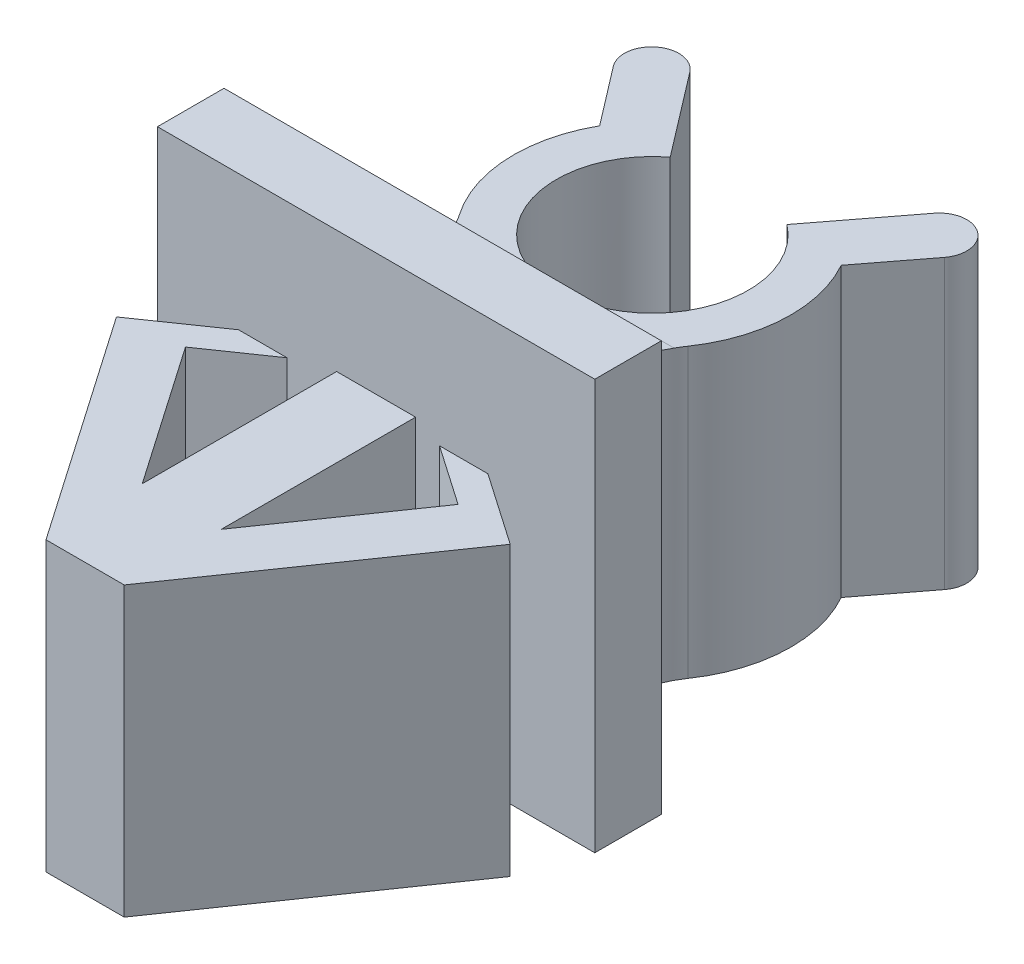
ISO-10303-21;
HEADER;
FILE_DESCRIPTION(('STEP AP214'),'2;1');
FILE_NAME('part.step','',(''),(''),'','','');
FILE_SCHEMA(('AUTOMOTIVE_DESIGN { 1 0 10303 214 1 1 1 1 }'));
ENDSEC;
DATA;
#1=APPLICATION_CONTEXT('core data for automotive mechanical design processes');
#2=APPLICATION_PROTOCOL_DEFINITION('international standard','automotive_design',2000,#1);
#3=PRODUCT_CONTEXT('',#1,'mechanical');
#4=PRODUCT('Part','Part','',(#3));
#5=PRODUCT_RELATED_PRODUCT_CATEGORY('part','',(#4));
#6=PRODUCT_DEFINITION_FORMATION('','',#4);
#7=PRODUCT_DEFINITION_CONTEXT('part definition',#1,'design');
#8=PRODUCT_DEFINITION('design','',#6,#7);
#9=PRODUCT_DEFINITION_SHAPE('','',#8);
#10=(LENGTH_UNIT() NAMED_UNIT(*) SI_UNIT(.MILLI.,.METRE.));
#11=(NAMED_UNIT(*) PLANE_ANGLE_UNIT() SI_UNIT($,.RADIAN.));
#12=(NAMED_UNIT(*) SI_UNIT($,.STERADIAN.) SOLID_ANGLE_UNIT());
#13=UNCERTAINTY_MEASURE_WITH_UNIT(LENGTH_MEASURE(1.E-05),#10,'distance_accuracy_value','');
#14=(GEOMETRIC_REPRESENTATION_CONTEXT(3) GLOBAL_UNCERTAINTY_ASSIGNED_CONTEXT((#13)) GLOBAL_UNIT_ASSIGNED_CONTEXT((#10,
#11,#12)) REPRESENTATION_CONTEXT('',''));
#15=CARTESIAN_POINT('',(0.,0.,0.));
#16=DIRECTION('',(0.,0.,1.));
#17=DIRECTION('',(1.,0.,0.));
#18=AXIS2_PLACEMENT_3D('',#15,#16,#17);
#19=CARTESIAN_POINT('',(-7.14375,9.4,5.84908968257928));
#20=DIRECTION('',(0.,0.,-1.));
#21=DIRECTION('',(-1.,0.,0.));
#22=AXIS2_PLACEMENT_3D('',#19,#20,#21);
#23=PLANE('',#22);
#24=CARTESIAN_POINT('',(-2.35364242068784,9.4,2.07342449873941));
#25=CARTESIAN_POINT('',(-2.04659834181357,8.4371931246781,5.84908968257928));
#26=CARTESIAN_POINT('',(-3.23413680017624,12.1609913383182,5.84908968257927));
#27=CARTESIAN_POINT('',(-2.33180267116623,9.4,2.09820539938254));
#28=CARTESIAN_POINT('',(-2.05429269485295,8.47085636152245,5.84908968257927));
#29=CARTESIAN_POINT('',(-3.16546787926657,12.1828929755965,5.84908968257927));
#30=CARTESIAN_POINT('',(-2.30861597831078,9.4,2.12374791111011));
#31=CARTESIAN_POINT('',(-2.05826676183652,8.50619266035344,5.84908968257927));
#32=CARTESIAN_POINT('',(-3.09623609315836,12.2029605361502,5.84908968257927));
#33=CARTESIAN_POINT('',(-2.25921651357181,9.4,2.17622807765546));
#34=CARTESIAN_POINT('',(-2.058273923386,8.57895356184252,5.84908968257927));
#35=CARTESIAN_POINT('',(-2.95689743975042,12.2396371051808,5.84908968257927));
#36=CARTESIAN_POINT('',(-2.23300527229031,9.4,2.20316502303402));
#37=CARTESIAN_POINT('',(-2.05440045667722,8.61633817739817,5.84908968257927));
#38=CARTESIAN_POINT('',(-2.88679103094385,12.256247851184,5.84908968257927));
#39=CARTESIAN_POINT('',(-2.14952478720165,9.4,2.28569418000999));
#40=CARTESIAN_POINT('',(-2.03077102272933,8.72936145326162,5.84908968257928));
#41=CARTESIAN_POINT('',(-2.67599284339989,12.3011194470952,5.84908968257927));
#42=CARTESIAN_POINT('',(-2.08723998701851,9.4,2.343204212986));
#43=CARTESIAN_POINT('',(-1.99936711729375,8.80729499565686,5.84908968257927));
#44=CARTESIAN_POINT('',(-2.53427102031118,12.3245907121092,5.84908968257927));
#45=CARTESIAN_POINT('',(-1.94669335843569,9.4,2.46119680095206));
#46=CARTESIAN_POINT('',(-1.90430862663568,8.96076752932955,5.84908968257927));
#47=CARTESIAN_POINT('',(-2.25010803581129,12.360814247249,5.84908968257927));
#48=CARTESIAN_POINT('',(-1.86849398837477,9.4,2.52166705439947));
#49=CARTESIAN_POINT('',(-1.84152982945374,9.03632238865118,5.84908968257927));
#50=CARTESIAN_POINT('',(-2.10767174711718,12.3736074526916,5.84908968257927));
#51=CARTESIAN_POINT('',(-1.69314405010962,9.4,2.64259684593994));
#52=CARTESIAN_POINT('',(-1.68586264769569,9.17946120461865,5.84908968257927));
#53=CARTESIAN_POINT('',(-1.82219180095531,12.3912348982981,5.84908968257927));
#54=CARTESIAN_POINT('',(-1.59597235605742,9.4,2.70305629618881));
#55=CARTESIAN_POINT('',(-1.59353068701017,9.2472672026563,5.84908968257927));
#56=CARTESIAN_POINT('',(-1.67914764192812,12.3960602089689,5.84908968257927));
#57=CARTESIAN_POINT('',(-1.41696348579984,9.4,2.79955940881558));
#58=CARTESIAN_POINT('',(-1.41736212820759,9.3498943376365,5.84908968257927));
#59=CARTESIAN_POINT('',(-1.44070661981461,12.3998410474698,5.84908968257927));
#60=CARTESIAN_POINT('',(-1.34081178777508,9.4,2.83702390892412));
#61=CARTESIAN_POINT('',(-1.34144228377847,9.38809721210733,5.84908968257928));
#62=CARTESIAN_POINT('',(-1.34532124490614,12.4002170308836,5.84908968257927));
#63=CARTESIAN_POINT('',(-1.17951902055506,9.4,2.90778416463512));
#64=CARTESIAN_POINT('',(-1.17967728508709,9.45776262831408,5.84908968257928));
#65=CARTESIAN_POINT('',(-1.15455287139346,12.3995669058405,5.84908968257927));
#66=CARTESIAN_POINT('',(-1.09437760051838,9.4,2.94107975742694));
#67=CARTESIAN_POINT('',(-1.09381963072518,9.48935759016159,5.84908968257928));
#68=CARTESIAN_POINT('',(-1.05916987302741,12.3985407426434,5.84908968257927));
#69=CARTESIAN_POINT('',(-0.915913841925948,9.4,3.00144626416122));
#70=CARTESIAN_POINT('',(-0.914105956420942,9.54494181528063,5.84908968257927));
#71=CARTESIAN_POINT('',(-0.868461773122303,12.3959118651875,5.84908968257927));
#72=CARTESIAN_POINT('',(-0.822595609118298,9.4,3.02852027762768));
#73=CARTESIAN_POINT('',(-0.820141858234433,9.56906600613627,5.84908968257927));
#74=CARTESIAN_POINT('',(-0.773136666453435,12.3943094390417,5.84908968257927));
#75=CARTESIAN_POINT('',(-0.62933893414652,9.4,3.07449318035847));
#76=CARTESIAN_POINT('',(-0.626400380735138,9.6091225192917,5.84908968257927));
#77=CARTESIAN_POINT('',(-0.58248601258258,12.3912426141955,5.84908968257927));
#78=CARTESIAN_POINT('',(-0.529400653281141,9.4,3.09339226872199));
#79=CARTESIAN_POINT('',(-0.526411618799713,9.62516576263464,5.84908968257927));
#80=CARTESIAN_POINT('',(-0.487160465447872,12.3897782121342,5.84908968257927));
#81=CARTESIAN_POINT('',(-0.325002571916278,9.4,3.12149971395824));
#82=CARTESIAN_POINT('',(-0.322798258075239,9.64872480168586,5.84908968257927));
#83=CARTESIAN_POINT('',(-0.296206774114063,12.3875089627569,5.84908968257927));
#84=CARTESIAN_POINT('',(-0.220529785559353,9.4,3.13067802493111));
#85=CARTESIAN_POINT('',(-0.218868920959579,9.65628691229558,5.84908968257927));
#86=CARTESIAN_POINT('',(-0.200578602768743,12.3867061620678,5.84908968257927));
#87=CARTESIAN_POINT('',(-0.0103980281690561,9.4,3.13841756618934));
#88=CARTESIAN_POINT('',(-0.0103544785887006,9.662652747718,5.84908968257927));
#89=CARTESIAN_POINT('',(-0.00931899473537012,12.3860329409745,5.84908968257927));
#90=CARTESIAN_POINT('',(0.095260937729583,9.4,3.13697884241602));
#91=CARTESIAN_POINT('',(0.0945664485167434,9.66147709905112,5.84908968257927));
#92=CARTESIAN_POINT('',(0.0863124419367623,12.3861625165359,5.84908968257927));
#93=CARTESIAN_POINT('',(0.304609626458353,9.4,3.12361144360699));
#94=CARTESIAN_POINT('',(0.302437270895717,9.65044968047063,5.84908968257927));
#95=CARTESIAN_POINT('',(0.277636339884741,12.3873124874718,5.84908968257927));
#96=CARTESIAN_POINT('',(0.408297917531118,9.4,3.11167541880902));
#97=CARTESIAN_POINT('',(0.405715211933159,9.64055638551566,5.84908968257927));
#98=CARTESIAN_POINT('',(0.373328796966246,12.3883335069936,5.84908968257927));
#99=CARTESIAN_POINT('',(0.610707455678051,9.4,3.07835812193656));
#100=CARTESIAN_POINT('',(0.607673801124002,9.61238873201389,5.84908968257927));
#101=CARTESIAN_POINT('',(0.56470737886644,12.3909242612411,5.84908968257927));
#102=CARTESIAN_POINT('',(0.709428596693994,9.4,3.0569766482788));
#103=CARTESIAN_POINT('',(0.706629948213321,9.59402917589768,5.84908968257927));
#104=CARTESIAN_POINT('',(0.660393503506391,12.3924940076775,5.84908968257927));
#105=CARTESIAN_POINT('',(0.900294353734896,9.4,3.00632936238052));
#106=CARTESIAN_POINT('',(0.898294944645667,9.54929159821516,5.84908968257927));
#107=CARTESIAN_POINT('',(0.852393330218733,12.3956013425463,5.84908968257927));
#108=CARTESIAN_POINT('',(0.992391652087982,9.4,2.97701281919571));
#109=CARTESIAN_POINT('',(0.991144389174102,9.5227413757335,5.84908968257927));
#110=CARTESIAN_POINT('',(0.948707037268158,12.3971386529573,5.84908968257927));
#111=CARTESIAN_POINT('',(1.16789294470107,9.4,2.91264401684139));
#112=CARTESIAN_POINT('',(1.16788694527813,9.46239353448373,5.84908968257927));
#113=CARTESIAN_POINT('',(1.14134497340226,12.3993939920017,5.84908968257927));
#114=CARTESIAN_POINT('',(1.25129706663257,9.4,2.8775918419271));
#115=CARTESIAN_POINT('',(1.25186624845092,9.42845831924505,5.84908968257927));
#116=CARTESIAN_POINT('',(1.2376692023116,12.4001120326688,5.84908968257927));
#117=CARTESIAN_POINT('',(1.40870759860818,9.4,2.80389232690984));
#118=CARTESIAN_POINT('',(1.40908488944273,9.35434352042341,5.84908968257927));
#119=CARTESIAN_POINT('',(1.43015195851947,12.3998596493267,5.84908968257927));
#120=CARTESIAN_POINT('',(1.48273021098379,9.4,2.76525139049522));
#121=CARTESIAN_POINT('',(1.48232806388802,9.3140413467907,5.84908968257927));
#122=CARTESIAN_POINT('',(1.52631048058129,12.3988921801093,5.84908968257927));
#123=CARTESIAN_POINT('',(1.62163309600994,9.4,2.68615353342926));
#124=CARTESIAN_POINT('',(1.61693282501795,9.22829826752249,5.84908968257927));
#125=CARTESIAN_POINT('',(1.71858128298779,12.394383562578,5.84908968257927));
#126=CARTESIAN_POINT('',(1.68651277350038,9.4,2.64569649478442));
#127=CARTESIAN_POINT('',(1.67819043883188,9.18274556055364,5.84908968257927));
#128=CARTESIAN_POINT('',(1.81469355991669,12.3908422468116,5.84908968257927));
#129=CARTESIAN_POINT('',(1.80748682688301,9.4,2.56456779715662));
#130=CARTESIAN_POINT('',(1.78765224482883,9.08800508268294,5.84908968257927));
#131=CARTESIAN_POINT('',(2.00650154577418,12.3803286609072,5.84908968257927));
#132=CARTESIAN_POINT('',(1.8636026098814,9.4,2.52389692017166));
#133=CARTESIAN_POINT('',(1.83572298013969,9.0387478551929,5.84908968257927));
#134=CARTESIAN_POINT('',(2.10219769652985,12.373364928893,5.84908968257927));
#135=CARTESIAN_POINT('',(1.96797677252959,9.4,2.44338469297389));
#136=CARTESIAN_POINT('',(1.91828194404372,8.93810828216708,5.84908968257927));
#137=CARTESIAN_POINT('',(2.2931694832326,12.3552041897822,5.84908968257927));
#138=CARTESIAN_POINT('',(2.01623745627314,9.4,2.40354310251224));
#139=CARTESIAN_POINT('',(1.9525656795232,8.8866909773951,5.84908968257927));
#140=CARTESIAN_POINT('',(2.38844523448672,12.3440084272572,5.84908968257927));
#141=CARTESIAN_POINT('',(2.10608011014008,9.4,2.32523955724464));
#142=CARTESIAN_POINT('',(2.00733286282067,8.78317477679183,5.84908968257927));
#143=CARTESIAN_POINT('',(2.57894415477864,12.3165481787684,5.84908968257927));
#144=CARTESIAN_POINT('',(2.14761440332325,9.4,2.28678883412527));
#145=CARTESIAN_POINT('',(2.02748555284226,8.73108936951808,5.84908968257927));
#146=CARTESIAN_POINT('',(2.6741625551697,12.3002497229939,5.84908968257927));
#147=CARTESIAN_POINT('',(2.22451510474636,9.4,2.21202996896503));
#148=CARTESIAN_POINT('',(2.0536452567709,8.62852157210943,5.84908968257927));
#149=CARTESIAN_POINT('',(2.86355282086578,12.2619498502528,5.84908968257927));
#150=CARTESIAN_POINT('',(2.25987431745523,9.4,2.17572435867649));
#151=CARTESIAN_POINT('',(2.05940383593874,8.57809707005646,5.84908968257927));
#152=CARTESIAN_POINT('',(2.95772334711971,12.2399418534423,5.84908968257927));
#153=CARTESIAN_POINT('',(2.29255481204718,9.4,2.14077421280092));
#154=CARTESIAN_POINT('',(2.05810632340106,8.53000978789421,5.84908968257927));
#155=CARTESIAN_POINT('',(3.05108967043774,12.2147671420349,5.84908968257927));
#156=(BOUNDED_SURFACE() B_SPLINE_SURFACE(3,2,((#24,#25,#26),(#27,#28,#29),(#30,#31,#32),(#33,
#34,#35),(#36,#37,#38),(#39,#40,#41),(#42,#43,#44),(#45,#46,#47),(#48,#49,#50),(#51,#52,#53),
(#54,#55,#56),(#57,#58,#59),(#60,#61,#62),(#63,#64,#65),(#66,#67,#68),(#69,#70,#71),(#72,#73,
#74),(#75,#76,#77),(#78,#79,#80),(#81,#82,#83),(#84,#85,#86),(#87,#88,#89),(#90,#91,#92),(#93,
#94,#95),(#96,#97,#98),(#99,#100,#101),(#102,#103,#104),(#105,#106,#107),(#108,#109,#110),(#111,
#112,#113),(#114,#115,#116),(#117,#118,#119),(#120,#121,#122),(#123,#124,#125),(#126,#127,#128),
(#129,#130,#131),(#132,#133,#134),(#135,#136,#137),(#138,#139,#140),(#141,#142,#143),(#144,#145,
#146),(#147,#148,#149),(#150,#151,#152),(#153,#154,#155)),.UNSPECIFIED.,.F.,.F.,
.F.) B_SPLINE_SURFACE_WITH_KNOTS((4,2,2,2,2,2,2,2,2,2,2,2,2,2,2,2,2,2,2,2,2,4),(3,3),(0.,
0.21617159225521,0.432234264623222,0.862635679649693,1.29137943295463,1.72060334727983,
2.00675150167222,2.2929108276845,2.57892728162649,2.86493676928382,3.15182772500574,
3.438717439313,3.72580818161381,4.01290505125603,4.30188262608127,4.59085595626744,
4.87932320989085,5.16780923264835,5.4555791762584,5.74326455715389,6.03290737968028,
6.32288548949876),(0.,1.),
.UNSPECIFIED.) GEOMETRIC_REPRESENTATION_ITEM() RATIONAL_B_SPLINE_SURFACE(((1.,0.608869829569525,
1.),(1.,0.61226158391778,1.),(1.,0.6157289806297,1.),(1.,0.622791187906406,1.),(1.,
0.626385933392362,1.),(1.,0.637301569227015,1.),(1.,0.644781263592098,1.),(1.,0.659854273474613,
1.),(1.,0.667447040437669,1.),(1.,0.682378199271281,1.),(1.,0.689716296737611,1.),(1.,
0.701260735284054,1.),(1.,0.705695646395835,1.),(1.,0.714002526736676,1.),(1.,0.717874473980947,
1.),(1.,0.724848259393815,1.),(1.,0.727950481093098,1.),(1.,0.733194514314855,1.),(1.,
0.735336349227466,1.),(1.,0.738514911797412,1.),(1.,0.739548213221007,1.),(1.,0.740419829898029,
1.),(1.,0.740258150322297,1.),(1.,0.738751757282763,1.),(1.,0.737406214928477,1.),(1.,
0.7336313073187,1.),(1.,0.731201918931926,1.),(1.,0.725406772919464,1.),(1.,0.722034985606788,
1.),(1.,0.714567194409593,1.),(1.,0.710471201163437,1.),(1.,0.701773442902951,1.),(1.,
0.697172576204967,1.),(1.,0.687652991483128,1.),(1.,0.682734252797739,1.),(1.,0.672758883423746,
1.),(1.,0.667702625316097,1.),(1.,0.657577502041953,1.),(1.,0.652508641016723,1.),(1.,
0.642430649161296,1.),(1.,0.637422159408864,1.),(1.,0.627573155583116,1.),(1.,0.622732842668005,
1.),(1.,0.618018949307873,1.))) REPRESENTATION_ITEM('') SURFACE());
#157=CARTESIAN_POINT('',(3.05108967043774,12.2147671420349,5.84908968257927));
#158=CARTESIAN_POINT('',(2.95772334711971,12.2399418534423,5.84908968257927));
#159=CARTESIAN_POINT('',(2.86355282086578,12.2619498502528,5.84908968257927));
#160=CARTESIAN_POINT('',(2.6741625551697,12.3002497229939,5.84908968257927));
#161=CARTESIAN_POINT('',(2.57894415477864,12.3165481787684,5.84908968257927));
#162=CARTESIAN_POINT('',(2.38844523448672,12.3440084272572,5.84908968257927));
#163=CARTESIAN_POINT('',(2.29316948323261,12.3552041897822,5.84908968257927));
#164=CARTESIAN_POINT('',(2.10219769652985,12.373364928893,5.84908968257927));
#165=CARTESIAN_POINT('',(2.00650154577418,12.3803286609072,5.84908968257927));
#166=CARTESIAN_POINT('',(1.81469355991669,12.3908422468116,5.84908968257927));
#167=CARTESIAN_POINT('',(1.71858128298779,12.394383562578,5.84908968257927));
#168=CARTESIAN_POINT('',(1.52631048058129,12.3988921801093,5.84908968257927));
#169=CARTESIAN_POINT('',(1.43015195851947,12.3998596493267,5.84908968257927));
#170=CARTESIAN_POINT('',(1.2376692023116,12.4001120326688,5.84908968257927));
#171=CARTESIAN_POINT('',(1.14134497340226,12.3993939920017,5.84908968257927));
#172=CARTESIAN_POINT('',(0.948707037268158,12.3971386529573,5.84908968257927));
#173=CARTESIAN_POINT('',(0.852393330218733,12.3956013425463,5.84908968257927));
#174=CARTESIAN_POINT('',(0.660393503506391,12.3924940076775,5.84908968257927));
#175=CARTESIAN_POINT('',(0.56470737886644,12.3909242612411,5.84908968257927));
#176=CARTESIAN_POINT('',(0.373328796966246,12.3883335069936,5.84908968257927));
#177=CARTESIAN_POINT('',(0.277636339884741,12.3873124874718,5.84908968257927));
#178=CARTESIAN_POINT('',(0.0863124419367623,12.3861625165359,5.84908968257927));
#179=CARTESIAN_POINT('',(-0.00931899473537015,12.3860329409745,5.84908968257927));
#180=CARTESIAN_POINT('',(-0.200578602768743,12.3867061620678,5.84908968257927));
#181=CARTESIAN_POINT('',(-0.296206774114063,12.3875089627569,5.84908968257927));
#182=CARTESIAN_POINT('',(-0.487160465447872,12.3897782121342,5.84908968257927));
#183=CARTESIAN_POINT('',(-0.58248601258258,12.3912426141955,5.84908968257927));
#184=CARTESIAN_POINT('',(-0.773136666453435,12.3943094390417,5.84908968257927));
#185=CARTESIAN_POINT('',(-0.868461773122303,12.3959118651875,5.84908968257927));
#186=CARTESIAN_POINT('',(-1.05916987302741,12.3985407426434,5.84908968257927));
#187=CARTESIAN_POINT('',(-1.15455287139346,12.3995669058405,5.84908968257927));
#188=CARTESIAN_POINT('',(-1.34532124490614,12.4002170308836,5.84908968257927));
#189=CARTESIAN_POINT('',(-1.44070661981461,12.3998410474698,5.84908968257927));
#190=CARTESIAN_POINT('',(-1.67914764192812,12.3960602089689,5.84908968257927));
#191=CARTESIAN_POINT('',(-1.82219180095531,12.3912348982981,5.84908968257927));
#192=CARTESIAN_POINT('',(-2.10767174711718,12.3736074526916,5.84908968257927));
#193=CARTESIAN_POINT('',(-2.25010803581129,12.360814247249,5.84908968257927));
#194=CARTESIAN_POINT('',(-2.53427102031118,12.3245907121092,5.84908968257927));
#195=CARTESIAN_POINT('',(-2.67599284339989,12.3011194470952,5.84908968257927));
#196=CARTESIAN_POINT('',(-2.88679103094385,12.256247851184,5.84908968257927));
#197=CARTESIAN_POINT('',(-2.95689743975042,12.2396371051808,5.84908968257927));
#198=CARTESIAN_POINT('',(-3.09623609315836,12.2029605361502,5.84908968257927));
#199=CARTESIAN_POINT('',(-3.16546787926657,12.1828929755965,5.84908968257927));
#200=CARTESIAN_POINT('',(-3.23413680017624,12.1609913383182,5.84908968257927));
#201=B_SPLINE_CURVE_WITH_KNOTS('',3,(#157,#158,#159,#160,#161,#162,#163,#164,#165,#166,#167,
#168,#169,#170,#171,#172,#173,#174,#175,#176,#177,#178,#179,#180,#181,#182,#183,#184,#185,#186,
#187,#188,#189,#190,#191,#192,#193,#194,#195,#196,#197,#198,#199,#200),.UNSPECIFIED.,.F.,.F.,(4,
2,2,2,2,2,2,2,2,2,2,2,2,2,2,2,2,2,2,2,2,4),(0.,0.28997810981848,0.579620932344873,
0.867306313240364,1.15507625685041,1.44356227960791,1.73202953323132,2.02100286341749,
2.30998043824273,2.59707730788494,2.88416805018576,3.17105776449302,3.45794872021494,
3.74395820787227,4.02997466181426,4.31613398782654,4.60228214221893,5.03150605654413,
5.46024980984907,5.89065122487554,6.10671389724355,6.32288548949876),.UNSPECIFIED.);
#202=CARTESIAN_POINT('',(1.31202506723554,12.4,5.84908968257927));
#203=VERTEX_POINT('',#202);
#204=CARTESIAN_POINT('',(-1.31202506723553,12.4,5.84908968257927));
#205=VERTEX_POINT('',#204);
#206=EDGE_CURVE('E510',#203,#205,#201,.T.);
#207=ORIENTED_EDGE('',*,*,#206,.T.);
#208=DIRECTION('',(1.,0.,0.));
#209=VECTOR('',#208,1.);
#210=CARTESIAN_POINT('',(-7.14375,12.4,5.84908968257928));
#211=LINE('',#210,#209);
#212=EDGE_CURVE('E641',#205,#203,#211,.T.);
#213=ORIENTED_EDGE('',*,*,#212,.T.);
#214=EDGE_LOOP('',(#207,#213));
#215=FACE_BOUND('',#214,.T.);
#216=ADVANCED_FACE('F35',(#215),#23,.T.);
#217=DIRECTION('',(1.,0.,0.));
#218=VECTOR('',#217,1.);
#219=CARTESIAN_POINT('',(-7.14375,12.4,5.84908968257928));
#220=LINE('',#219,#218);
#221=CARTESIAN_POINT('',(5.66913757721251,12.4,5.84908968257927));
#222=VERTEX_POINT('',#221);
#223=CARTESIAN_POINT('',(6.14375,12.4,5.84908968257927));
#224=VERTEX_POINT('',#223);
#225=EDGE_CURVE('E643',#222,#224,#220,.T.);
#226=ORIENTED_EDGE('',*,*,#225,.T.);
#227=DIRECTION('',(0.,-1.,0.));
#228=VECTOR('',#227,1.);
#229=CARTESIAN_POINT('',(6.14375,9.4,5.84908968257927));
#230=LINE('',#229,#228);
#231=CARTESIAN_POINT('',(6.14375,0.,5.84908968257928));
#232=VERTEX_POINT('',#231);
#233=EDGE_CURVE('E683',#224,#232,#230,.T.);
#234=ORIENTED_EDGE('',*,*,#233,.T.);
#235=DIRECTION('',(1.,0.,0.));
#236=VECTOR('',#235,1.);
#237=CARTESIAN_POINT('',(4.11074933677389,0.,5.84908968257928));
#238=LINE('',#237,#236);
#239=CARTESIAN_POINT('',(5.66913757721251,0.,5.84908968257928));
#240=VERTEX_POINT('',#239);
#241=EDGE_CURVE('E404',#240,#232,#238,.T.);
#242=ORIENTED_EDGE('',*,*,#241,.F.);
#243=DIRECTION('',(0.,-1.,0.));
#244=VECTOR('',#243,1.);
#245=CARTESIAN_POINT('',(5.66913757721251,9.4,5.84908968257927));
#246=LINE('',#245,#244);
#247=EDGE_CURVE('E633',#240,#222,#246,.F.);
#248=ORIENTED_EDGE('',*,*,#247,.T.);
#249=EDGE_LOOP('',(#226,#234,#242,#248));
#250=FACE_BOUND('',#249,.T.);
#251=ADVANCED_FACE('F531',(#250),#23,.T.);
#252=CARTESIAN_POINT('',(0.,9.4,0.));
#253=DIRECTION('',(0.,1.,0.));
#254=DIRECTION('',(0.,0.,1.));
#255=AXIS2_PLACEMENT_3D('',#252,#253,#254);
#256=PLANE('',#255);
#257=CARTESIAN_POINT('',(0.,9.4,0.));
#258=DIRECTION('',(0.,1.,0.));
#259=DIRECTION('',(0.,0.,1.));
#260=AXIS2_PLACEMENT_3D('',#257,#258,#259);
#261=CIRCLE('',#260,4.52956830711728);
#262=CARTESIAN_POINT('',(-3.94593431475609,9.4,-2.224093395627));
#263=VERTEX_POINT('',#262);
#264=CARTESIAN_POINT('',(-3.72946628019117,9.4,2.57061671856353));
#265=VERTEX_POINT('',#264);
#266=EDGE_CURVE('E360',#263,#265,#261,.T.);
#267=ORIENTED_EDGE('',*,*,#266,.T.);
#268=CARTESIAN_POINT('',(-6.19954688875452,9.4,4.2731741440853));
#269=DIRECTION('',(0.,1.,0.));
#270=DIRECTION('',(0.,0.,1.));
#271=AXIS2_PLACEMENT_3D('',#268,#269,#270);
#272=CIRCLE('',#271,3.);
#273=CARTESIAN_POINT('',(-3.55909551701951,9.4,2.84908968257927));
#274=VERTEX_POINT('',#273);
#275=EDGE_CURVE('E48',#265,#274,#272,.F.);
#276=ORIENTED_EDGE('',*,*,#275,.T.);
#277=DIRECTION('',(-1.,0.,0.));
#278=VECTOR('',#277,1.);
#279=CARTESIAN_POINT('',(4.11074933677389,9.4,2.84908968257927));
#280=LINE('',#279,#278);
#281=CARTESIAN_POINT('',(-1.31202506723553,9.4,2.84908968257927));
#282=VERTEX_POINT('',#281);
#283=EDGE_CURVE('E54',#274,#282,#280,.F.);
#284=ORIENTED_EDGE('',*,*,#283,.T.);
#285=CARTESIAN_POINT('',(0.,9.4,0.));
#286=DIRECTION('',(0.,1.,0.));
#287=DIRECTION('',(0.,0.,1.));
#288=AXIS2_PLACEMENT_3D('',#285,#286,#287);
#289=CIRCLE('',#288,3.13667368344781);
#290=CARTESIAN_POINT('',(-1.90629007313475,9.4,-2.49093957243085));
#291=VERTEX_POINT('',#290);
#292=EDGE_CURVE('E349',#291,#282,#289,.T.);
#293=ORIENTED_EDGE('',*,*,#292,.F.);
#294=DIRECTION('',(-0.607742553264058,0.,-0.794134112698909));
#295=VECTOR('',#294,1.);
#296=CARTESIAN_POINT('',(-1.90629007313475,9.4,-2.49093957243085));
#297=LINE('',#296,#295);
#298=CARTESIAN_POINT('',(-3.9940475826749,9.4,-5.21900172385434));
#299=VERTEX_POINT('',#298);
#300=EDGE_CURVE('E352',#291,#299,#297,.T.);
#301=ORIENTED_EDGE('',*,*,#300,.T.);
#302=CARTESIAN_POINT('',(-4.70159123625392,9.4,-4.67752594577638));
#303=DIRECTION('',(0.,-1.,0.));
#304=DIRECTION('',(0.,0.,-1.));
#305=AXIS2_PLACEMENT_3D('',#302,#303,#304);
#306=CIRCLE('',#305,0.890962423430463);
#307=CARTESIAN_POINT('',(-5.40913488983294,9.4,-4.13605016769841));
#308=VERTEX_POINT('',#307);
#309=EDGE_CURVE('E355',#308,#299,#306,.T.);
#310=ORIENTED_EDGE('',*,*,#309,.F.);
#311=DIRECTION('',(0.607742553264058,0.,0.794134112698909));
#312=VECTOR('',#311,1.);
#313=CARTESIAN_POINT('',(-5.40913488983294,9.4,-4.13605016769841));
#314=LINE('',#313,#312);
#315=EDGE_CURVE('E358',#308,#263,#314,.T.);
#316=ORIENTED_EDGE('',*,*,#315,.T.);
#317=EDGE_LOOP('',(#267,#276,#284,#293,#301,#310,#316));
#318=FACE_BOUND('',#317,.T.);
#319=ADVANCED_FACE('F599',(#318),#256,.T.);
#320=CARTESIAN_POINT('',(1.31202506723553,9.4,2.84908968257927));
#321=VERTEX_POINT('',#320);
#322=CARTESIAN_POINT('',(1.90629007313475,9.4,-2.49093957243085));
#323=VERTEX_POINT('',#322);
#324=EDGE_CURVE('E348',#321,#323,#289,.T.);
#325=ORIENTED_EDGE('',*,*,#324,.F.);
#326=DIRECTION('',(-1.,0.,0.));
#327=VECTOR('',#326,1.);
#328=CARTESIAN_POINT('',(4.11074933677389,9.4,2.84908968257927));
#329=LINE('',#328,#327);
#330=CARTESIAN_POINT('',(3.55909551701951,9.4,2.84908968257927));
#331=VERTEX_POINT('',#330);
#332=EDGE_CURVE('E62',#321,#331,#329,.F.);
#333=ORIENTED_EDGE('',*,*,#332,.T.);
#334=CARTESIAN_POINT('',(6.19954688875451,9.4,4.27317414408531));
#335=DIRECTION('',(0.,1.,0.));
#336=DIRECTION('',(0.,0.,1.));
#337=AXIS2_PLACEMENT_3D('',#334,#335,#336);
#338=CIRCLE('',#337,3.);
#339=CARTESIAN_POINT('',(3.72946628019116,9.4,2.57061671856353));
#340=VERTEX_POINT('',#339);
#341=EDGE_CURVE('E591',#331,#340,#338,.F.);
#342=ORIENTED_EDGE('',*,*,#341,.T.);
#343=CARTESIAN_POINT('',(0.,9.4,0.));
#344=DIRECTION('',(0.,1.,0.));
#345=DIRECTION('',(0.,0.,1.));
#346=AXIS2_PLACEMENT_3D('',#343,#344,#345);
#347=CIRCLE('',#346,4.52956830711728);
#348=CARTESIAN_POINT('',(3.94593431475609,9.4,-2.224093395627));
#349=VERTEX_POINT('',#348);
#350=EDGE_CURVE('E338',#340,#349,#347,.T.);
#351=ORIENTED_EDGE('',*,*,#350,.T.);
#352=DIRECTION('',(-0.607742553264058,0.,0.794134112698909));
#353=VECTOR('',#352,1.);
#354=CARTESIAN_POINT('',(5.40913488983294,9.4,-4.13605016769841));
#355=LINE('',#354,#353);
#356=CARTESIAN_POINT('',(5.40913488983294,9.4,-4.13605016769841));
#357=VERTEX_POINT('',#356);
#358=EDGE_CURVE('E340',#357,#349,#355,.T.);
#359=ORIENTED_EDGE('',*,*,#358,.F.);
#360=CARTESIAN_POINT('',(4.70159123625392,9.4,-4.67752594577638));
#361=DIRECTION('',(0.,1.,0.));
#362=DIRECTION('',(0.,0.,1.));
#363=AXIS2_PLACEMENT_3D('',#360,#361,#362);
#364=CIRCLE('',#363,0.890962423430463);
#365=CARTESIAN_POINT('',(3.9940475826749,9.4,-5.21900172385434));
#366=VERTEX_POINT('',#365);
#367=EDGE_CURVE('E343',#357,#366,#364,.T.);
#368=ORIENTED_EDGE('',*,*,#367,.T.);
#369=DIRECTION('',(0.607742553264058,0.,-0.794134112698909));
#370=VECTOR('',#369,1.);
#371=CARTESIAN_POINT('',(1.90629007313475,9.4,-2.49093957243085));
#372=LINE('',#371,#370);
#373=EDGE_CURVE('E345',#323,#366,#372,.T.);
#374=ORIENTED_EDGE('',*,*,#373,.F.);
#375=EDGE_LOOP('',(#325,#333,#342,#351,#359,#368,#374));
#376=FACE_BOUND('',#375,.T.);
#377=ADVANCED_FACE('F655',(#376),#256,.T.);
#378=CARTESIAN_POINT('',(-7.14375,9.4,5.84908968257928));
#379=DIRECTION('',(1.,0.,0.));
#380=DIRECTION('',(0.,0.,-1.));
#381=AXIS2_PLACEMENT_3D('',#378,#379,#380);
#382=PLANE('',#381);
#383=DIRECTION('',(0.,0.,1.));
#384=VECTOR('',#383,1.);
#385=CARTESIAN_POINT('',(-7.14375,13.4,5.84908968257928));
#386=LINE('',#385,#384);
#387=CARTESIAN_POINT('',(-7.14375,13.4,6.84908968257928));
#388=VERTEX_POINT('',#387);
#389=CARTESIAN_POINT('',(-7.14375,13.4,9.02408968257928));
#390=VERTEX_POINT('',#389);
#391=EDGE_CURVE('E278',#388,#390,#386,.T.);
#392=ORIENTED_EDGE('',*,*,#391,.F.);
#393=DIRECTION('',(0.,-1.,0.));
#394=VECTOR('',#393,1.);
#395=CARTESIAN_POINT('',(-7.14375,0.,6.84908968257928));
#396=LINE('',#395,#394);
#397=CARTESIAN_POINT('',(-7.14375,0.,6.84908968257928));
#398=VERTEX_POINT('',#397);
#399=EDGE_CURVE('E696',#388,#398,#396,.T.);
#400=ORIENTED_EDGE('',*,*,#399,.T.);
#401=DIRECTION('',(0.,0.,1.));
#402=VECTOR('',#401,1.);
#403=CARTESIAN_POINT('',(-7.14375,0.,5.84908968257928));
#404=LINE('',#403,#402);
#405=CARTESIAN_POINT('',(-7.14375,0.,9.02408968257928));
#406=VERTEX_POINT('',#405);
#407=EDGE_CURVE('E295',#398,#406,#404,.T.);
#408=ORIENTED_EDGE('',*,*,#407,.T.);
#409=DIRECTION('',(0.,-1.,0.));
#410=VECTOR('',#409,1.);
#411=CARTESIAN_POINT('',(-7.14375,9.4,9.02408968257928));
#412=LINE('',#411,#410);
#413=EDGE_CURVE('E292',#390,#406,#412,.T.);
#414=ORIENTED_EDGE('',*,*,#413,.F.);
#415=EDGE_LOOP('',(#392,#400,#408,#414));
#416=FACE_BOUND('',#415,.T.);
#417=ADVANCED_FACE('F293',(#416),#382,.F.);
#418=CARTESIAN_POINT('',(-1.29027598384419,9.4,9.02408968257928));
#419=DIRECTION('',(1.,0.,0.));
#420=DIRECTION('',(0.,0.,-1.));
#421=AXIS2_PLACEMENT_3D('',#418,#419,#420);
#422=PLANE('',#421);
#423=DIRECTION('',(0.,0.,1.));
#424=VECTOR('',#423,1.);
#425=CARTESIAN_POINT('',(-1.29027598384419,0.,9.02408968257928));
#426=LINE('',#425,#424);
#427=CARTESIAN_POINT('',(-1.29027598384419,0.,9.02408968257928));
#428=VERTEX_POINT('',#427);
#429=CARTESIAN_POINT('',(-1.29027598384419,0.,15.3740896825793));
#430=VERTEX_POINT('',#429);
#431=EDGE_CURVE('E367',#428,#430,#426,.T.);
#432=ORIENTED_EDGE('',*,*,#431,.T.);
#433=DIRECTION('',(0.,-1.,0.));
#434=VECTOR('',#433,1.);
#435=CARTESIAN_POINT('',(-1.29027598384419,9.4,15.3740896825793));
#436=LINE('',#435,#434);
#437=CARTESIAN_POINT('',(-1.29027598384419,9.4,15.3740896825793));
#438=VERTEX_POINT('',#437);
#439=EDGE_CURVE('E480',#438,#430,#436,.T.);
#440=ORIENTED_EDGE('',*,*,#439,.F.);
#441=DIRECTION('',(0.,0.,1.));
#442=VECTOR('',#441,1.);
#443=CARTESIAN_POINT('',(-1.29027598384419,9.4,9.02408968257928));
#444=LINE('',#443,#442);
#445=CARTESIAN_POINT('',(-1.29027598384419,9.4,9.02408968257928));
#446=VERTEX_POINT('',#445);
#447=EDGE_CURVE('E312',#446,#438,#444,.T.);
#448=ORIENTED_EDGE('',*,*,#447,.F.);
#449=DIRECTION('',(0.,-1.,0.));
#450=VECTOR('',#449,1.);
#451=CARTESIAN_POINT('',(-1.29027598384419,9.4,9.02408968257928));
#452=LINE('',#451,#450);
#453=EDGE_CURVE('E299',#446,#428,#452,.T.);
#454=ORIENTED_EDGE('',*,*,#453,.T.);
#455=EDGE_LOOP('',(#432,#440,#448,#454));
#456=FACE_BOUND('',#455,.T.);
#457=ADVANCED_FACE('F798',(#456),#422,.F.);
#458=CARTESIAN_POINT('',(-1.29027598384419,9.4,15.3740896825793));
#459=DIRECTION('',(-0.822563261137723,0.,0.568673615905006));
#460=DIRECTION('',(0.568673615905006,0.,0.822563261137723));
#461=AXIS2_PLACEMENT_3D('',#458,#459,#460);
#462=PLANE('',#461);
#463=DIRECTION('',(-0.568673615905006,0.,-0.822563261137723));
#464=VECTOR('',#463,1.);
#465=CARTESIAN_POINT('',(-1.29027598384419,0.,15.3740896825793));
#466=LINE('',#465,#464);
#467=CARTESIAN_POINT('',(-4.45248164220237,0.,10.8000877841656));
#468=VERTEX_POINT('',#467);
#469=EDGE_CURVE('E369',#430,#468,#466,.T.);
#470=ORIENTED_EDGE('',*,*,#469,.T.);
#471=DIRECTION('',(0.,-1.,0.));
#472=VECTOR('',#471,1.);
#473=CARTESIAN_POINT('',(-4.45248164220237,9.4,10.8000877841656));
#474=LINE('',#473,#472);
#475=CARTESIAN_POINT('',(-4.45248164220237,9.4,10.8000877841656));
#476=VERTEX_POINT('',#475);
#477=EDGE_CURVE('E477',#476,#468,#474,.T.);
#478=ORIENTED_EDGE('',*,*,#477,.F.);
#479=DIRECTION('',(-0.568673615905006,0.,-0.822563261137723));
#480=VECTOR('',#479,1.);
#481=CARTESIAN_POINT('',(-1.29027598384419,9.4,15.3740896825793));
#482=LINE('',#481,#480);
#483=EDGE_CURVE('E309',#438,#476,#482,.T.);
#484=ORIENTED_EDGE('',*,*,#483,.F.);
#485=ORIENTED_EDGE('',*,*,#439,.T.);
#486=EDGE_LOOP('',(#470,#478,#484,#485));
#487=FACE_BOUND('',#486,.T.);
#488=ADVANCED_FACE('F793',(#487),#462,.F.);
#489=CARTESIAN_POINT('',(-4.45248164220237,9.4,10.8000877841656));
#490=DIRECTION('',(-0.568673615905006,0.,-0.822563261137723));
#491=DIRECTION('',(-0.822563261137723,0.,0.568673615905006));
#492=AXIS2_PLACEMENT_3D('',#489,#490,#491);
#493=PLANE('',#492);
#494=DIRECTION('',(0.822563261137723,0.,-0.568673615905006));
#495=VECTOR('',#494,1.);
#496=CARTESIAN_POINT('',(-4.45248164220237,0.,10.8000877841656));
#497=LINE('',#496,#495);
#498=CARTESIAN_POINT('',(-2.4921951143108,0.,9.44485678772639));
#499=VERTEX_POINT('',#498);
#500=EDGE_CURVE('E371',#468,#499,#497,.T.);
#501=ORIENTED_EDGE('',*,*,#500,.T.);
#502=DIRECTION('',(0.,-1.,0.));
#503=VECTOR('',#502,1.);
#504=CARTESIAN_POINT('',(-2.4921951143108,9.4,9.44485678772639));
#505=LINE('',#504,#503);
#506=CARTESIAN_POINT('',(-2.4921951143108,9.4,9.44485678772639));
#507=VERTEX_POINT('',#506);
#508=EDGE_CURVE('E474',#507,#499,#505,.T.);
#509=ORIENTED_EDGE('',*,*,#508,.F.);
#510=DIRECTION('',(0.822563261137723,0.,-0.568673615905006));
#511=VECTOR('',#510,1.);
#512=CARTESIAN_POINT('',(-4.45248164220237,9.4,10.8000877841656));
#513=LINE('',#512,#511);
#514=EDGE_CURVE('E311',#476,#507,#513,.T.);
#515=ORIENTED_EDGE('',*,*,#514,.F.);
#516=ORIENTED_EDGE('',*,*,#477,.T.);
#517=EDGE_LOOP('',(#501,#509,#515,#516));
#518=FACE_BOUND('',#517,.T.);
#519=ADVANCED_FACE('F788',(#518),#493,.F.);
#520=CARTESIAN_POINT('',(-2.4921951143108,9.4,9.44485678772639));
#521=DIRECTION('',(0.,0.,1.));
#522=DIRECTION('',(1.,0.,0.));
#523=AXIS2_PLACEMENT_3D('',#520,#521,#522);
#524=PLANE('',#523);
#525=DIRECTION('',(-1.,0.,0.));
#526=VECTOR('',#525,1.);
#527=CARTESIAN_POINT('',(-2.4921951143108,0.,9.44485678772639));
#528=LINE('',#527,#526);
#529=CARTESIAN_POINT('',(-4.07329794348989,0.,9.44485678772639));
#530=VERTEX_POINT('',#529);
#531=EDGE_CURVE('E373',#499,#530,#528,.T.);
#532=ORIENTED_EDGE('',*,*,#531,.T.);
#533=DIRECTION('',(0.,-1.,0.));
#534=VECTOR('',#533,1.);
#535=CARTESIAN_POINT('',(-4.07329794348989,9.4,9.44485678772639));
#536=LINE('',#535,#534);
#537=CARTESIAN_POINT('',(-4.07329794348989,9.4,9.44485678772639));
#538=VERTEX_POINT('',#537);
#539=EDGE_CURVE('E471',#538,#530,#536,.T.);
#540=ORIENTED_EDGE('',*,*,#539,.F.);
#541=DIRECTION('',(-1.,0.,0.));
#542=VECTOR('',#541,1.);
#543=CARTESIAN_POINT('',(-2.4921951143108,9.4,9.44485678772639));
#544=LINE('',#543,#542);
#545=EDGE_CURVE('E314',#507,#538,#544,.T.);
#546=ORIENTED_EDGE('',*,*,#545,.F.);
#547=ORIENTED_EDGE('',*,*,#508,.T.);
#548=EDGE_LOOP('',(#532,#540,#546,#547));
#549=FACE_BOUND('',#548,.T.);
#550=ADVANCED_FACE('F784',(#549),#524,.F.);
#551=CARTESIAN_POINT('',(-4.07329794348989,9.4,9.44485678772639));
#552=DIRECTION('',(0.568673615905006,0.,0.822563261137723));
#553=DIRECTION('',(0.822563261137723,0.,-0.568673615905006));
#554=AXIS2_PLACEMENT_3D('',#551,#552,#553);
#555=PLANE('',#554);
#556=DIRECTION('',(-0.822563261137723,0.,0.568673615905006));
#557=VECTOR('',#556,1.);
#558=CARTESIAN_POINT('',(-4.07329794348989,0.,9.44485678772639));
#559=LINE('',#558,#557);
#560=CARTESIAN_POINT('',(-6.43203011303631,0.,11.0755505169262));
#561=VERTEX_POINT('',#560);
#562=EDGE_CURVE('E375',#530,#561,#559,.T.);
#563=ORIENTED_EDGE('',*,*,#562,.T.);
#564=DIRECTION('',(0.,-1.,0.));
#565=VECTOR('',#564,1.);
#566=CARTESIAN_POINT('',(-6.43203011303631,9.4,11.0755505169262));
#567=LINE('',#566,#565);
#568=CARTESIAN_POINT('',(-6.43203011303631,9.4,11.0755505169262));
#569=VERTEX_POINT('',#568);
#570=EDGE_CURVE('E468',#569,#561,#567,.T.);
#571=ORIENTED_EDGE('',*,*,#570,.F.);
#572=DIRECTION('',(-0.822563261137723,0.,0.568673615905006));
#573=VECTOR('',#572,1.);
#574=CARTESIAN_POINT('',(-4.07329794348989,9.4,9.44485678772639));
#575=LINE('',#574,#573);
#576=EDGE_CURVE('E316',#538,#569,#575,.T.);
#577=ORIENTED_EDGE('',*,*,#576,.F.);
#578=ORIENTED_EDGE('',*,*,#539,.T.);
#579=EDGE_LOOP('',(#563,#571,#577,#578));
#580=FACE_BOUND('',#579,.T.);
#581=ADVANCED_FACE('F779',(#580),#555,.F.);
#582=CARTESIAN_POINT('',(-6.43203011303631,9.4,11.0755505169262));
#583=DIRECTION('',(0.822563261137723,0.,-0.568673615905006));
#584=DIRECTION('',(-0.568673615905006,0.,-0.822563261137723));
#585=AXIS2_PLACEMENT_3D('',#582,#583,#584);
#586=PLANE('',#585);
#587=DIRECTION('',(0.568673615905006,0.,0.822563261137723));
#588=VECTOR('',#587,1.);
#589=CARTESIAN_POINT('',(-6.43203011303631,0.,11.0755505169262));
#590=LINE('',#589,#588);
#591=CARTESIAN_POINT('',(-1.27748358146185,0.,18.5313924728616));
#592=VERTEX_POINT('',#591);
#593=EDGE_CURVE('E377',#561,#592,#590,.T.);
#594=ORIENTED_EDGE('',*,*,#593,.T.);
#595=DIRECTION('',(0.,-1.,0.));
#596=VECTOR('',#595,1.);
#597=CARTESIAN_POINT('',(-1.27748358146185,9.4,18.5313924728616));
#598=LINE('',#597,#596);
#599=CARTESIAN_POINT('',(-1.27748358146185,9.4,18.5313924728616));
#600=VERTEX_POINT('',#599);
#601=EDGE_CURVE('E465',#600,#592,#598,.T.);
#602=ORIENTED_EDGE('',*,*,#601,.F.);
#603=DIRECTION('',(0.568673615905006,0.,0.822563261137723));
#604=VECTOR('',#603,1.);
#605=CARTESIAN_POINT('',(-6.43203011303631,9.4,11.0755505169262));
#606=LINE('',#605,#604);
#607=EDGE_CURVE('E318',#569,#600,#606,.T.);
#608=ORIENTED_EDGE('',*,*,#607,.F.);
#609=ORIENTED_EDGE('',*,*,#570,.T.);
#610=EDGE_LOOP('',(#594,#602,#608,#609));
#611=FACE_BOUND('',#610,.T.);
#612=ADVANCED_FACE('F773',(#611),#586,.F.);
#613=CARTESIAN_POINT('',(-1.27748358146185,9.4,18.5313924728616));
#614=DIRECTION('',(0.,0.,-1.));
#615=DIRECTION('',(-1.,0.,0.));
#616=AXIS2_PLACEMENT_3D('',#613,#614,#615);
#617=PLANE('',#616);
#618=DIRECTION('',(1.,0.,0.));
#619=VECTOR('',#618,1.);
#620=CARTESIAN_POINT('',(-1.27748358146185,0.,18.5313924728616));
#621=LINE('',#620,#619);
#622=CARTESIAN_POINT('',(1.27748358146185,0.,18.5313924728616));
#623=VERTEX_POINT('',#622);
#624=EDGE_CURVE('E379',#592,#623,#621,.T.);
#625=ORIENTED_EDGE('',*,*,#624,.T.);
#626=DIRECTION('',(0.,-1.,0.));
#627=VECTOR('',#626,1.);
#628=CARTESIAN_POINT('',(1.27748358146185,9.4,18.5313924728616));
#629=LINE('',#628,#627);
#630=CARTESIAN_POINT('',(1.27748358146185,9.4,18.5313924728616));
#631=VERTEX_POINT('',#630);
#632=EDGE_CURVE('E463',#631,#623,#629,.T.);
#633=ORIENTED_EDGE('',*,*,#632,.F.);
#634=DIRECTION('',(1.,0.,0.));
#635=VECTOR('',#634,1.);
#636=CARTESIAN_POINT('',(-1.27748358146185,9.4,18.5313924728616));
#637=LINE('',#636,#635);
#638=EDGE_CURVE('E320',#600,#631,#637,.T.);
#639=ORIENTED_EDGE('',*,*,#638,.F.);
#640=ORIENTED_EDGE('',*,*,#601,.T.);
#641=EDGE_LOOP('',(#625,#633,#639,#640));
#642=FACE_BOUND('',#641,.T.);
#643=ADVANCED_FACE('F769',(#642),#617,.F.);
#644=CARTESIAN_POINT('',(6.43203011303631,9.4,11.0755505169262));
#645=DIRECTION('',(0.822563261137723,0.,0.568673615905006));
#646=DIRECTION('',(0.568673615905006,0.,-0.822563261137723));
#647=AXIS2_PLACEMENT_3D('',#644,#645,#646);
#648=PLANE('',#647);
#649=DIRECTION('',(-0.568673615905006,0.,0.822563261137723));
#650=VECTOR('',#649,1.);
#651=CARTESIAN_POINT('',(6.43203011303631,0.,11.0755505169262));
#652=LINE('',#651,#650);
#653=CARTESIAN_POINT('',(6.43203011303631,0.,11.0755505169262));
#654=VERTEX_POINT('',#653);
#655=EDGE_CURVE('E382',#654,#623,#652,.T.);
#656=ORIENTED_EDGE('',*,*,#655,.F.);
#657=DIRECTION('',(0.,-1.,0.));
#658=VECTOR('',#657,1.);
#659=CARTESIAN_POINT('',(6.43203011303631,9.4,11.0755505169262));
#660=LINE('',#659,#658);
#661=CARTESIAN_POINT('',(6.43203011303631,9.4,11.0755505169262));
#662=VERTEX_POINT('',#661);
#663=EDGE_CURVE('E461',#662,#654,#660,.T.);
#664=ORIENTED_EDGE('',*,*,#663,.F.);
#665=DIRECTION('',(-0.568673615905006,0.,0.822563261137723));
#666=VECTOR('',#665,1.);
#667=CARTESIAN_POINT('',(6.43203011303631,9.4,11.0755505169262));
#668=LINE('',#667,#666);
#669=EDGE_CURVE('E322',#662,#631,#668,.T.);
#670=ORIENTED_EDGE('',*,*,#669,.T.);
#671=ORIENTED_EDGE('',*,*,#632,.T.);
#672=EDGE_LOOP('',(#656,#664,#670,#671));
#673=FACE_BOUND('',#672,.T.);
#674=ADVANCED_FACE('F764',(#673),#648,.T.);
#675=CARTESIAN_POINT('',(4.07329794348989,9.4,9.44485678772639));
#676=DIRECTION('',(0.568673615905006,0.,-0.822563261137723));
#677=DIRECTION('',(-0.822563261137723,0.,-0.568673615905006));
#678=AXIS2_PLACEMENT_3D('',#675,#676,#677);
#679=PLANE('',#678);
#680=DIRECTION('',(0.822563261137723,0.,0.568673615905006));
#681=VECTOR('',#680,1.);
#682=CARTESIAN_POINT('',(4.07329794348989,0.,9.44485678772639));
#683=LINE('',#682,#681);
#684=CARTESIAN_POINT('',(4.07329794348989,0.,9.44485678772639));
#685=VERTEX_POINT('',#684);
#686=EDGE_CURVE('E385',#685,#654,#683,.T.);
#687=ORIENTED_EDGE('',*,*,#686,.F.);
#688=DIRECTION('',(0.,-1.,0.));
#689=VECTOR('',#688,1.);
#690=CARTESIAN_POINT('',(4.07329794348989,9.4,9.44485678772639));
#691=LINE('',#690,#689);
#692=CARTESIAN_POINT('',(4.07329794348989,9.4,9.44485678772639));
#693=VERTEX_POINT('',#692);
#694=EDGE_CURVE('E459',#693,#685,#691,.T.);
#695=ORIENTED_EDGE('',*,*,#694,.F.);
#696=DIRECTION('',(0.822563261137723,0.,0.568673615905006));
#697=VECTOR('',#696,1.);
#698=CARTESIAN_POINT('',(4.07329794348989,9.4,9.44485678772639));
#699=LINE('',#698,#697);
#700=EDGE_CURVE('E325',#693,#662,#699,.T.);
#701=ORIENTED_EDGE('',*,*,#700,.T.);
#702=ORIENTED_EDGE('',*,*,#663,.T.);
#703=EDGE_LOOP('',(#687,#695,#701,#702));
#704=FACE_BOUND('',#703,.T.);
#705=ADVANCED_FACE('F759',(#704),#679,.T.);
#706=CARTESIAN_POINT('',(2.4921951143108,9.4,9.44485678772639));
#707=DIRECTION('',(0.,0.,-1.));
#708=DIRECTION('',(-1.,0.,0.));
#709=AXIS2_PLACEMENT_3D('',#706,#707,#708);
#710=PLANE('',#709);
#711=DIRECTION('',(1.,0.,0.));
#712=VECTOR('',#711,1.);
#713=CARTESIAN_POINT('',(2.4921951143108,0.,9.44485678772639));
#714=LINE('',#713,#712);
#715=CARTESIAN_POINT('',(2.4921951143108,0.,9.44485678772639));
#716=VERTEX_POINT('',#715);
#717=EDGE_CURVE('E388',#716,#685,#714,.T.);
#718=ORIENTED_EDGE('',*,*,#717,.F.);
#719=DIRECTION('',(0.,-1.,0.));
#720=VECTOR('',#719,1.);
#721=CARTESIAN_POINT('',(2.4921951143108,9.4,9.44485678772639));
#722=LINE('',#721,#720);
#723=CARTESIAN_POINT('',(2.4921951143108,9.4,9.44485678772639));
#724=VERTEX_POINT('',#723);
#725=EDGE_CURVE('E457',#724,#716,#722,.T.);
#726=ORIENTED_EDGE('',*,*,#725,.F.);
#727=DIRECTION('',(1.,0.,0.));
#728=VECTOR('',#727,1.);
#729=CARTESIAN_POINT('',(2.4921951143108,9.4,9.44485678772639));
#730=LINE('',#729,#728);
#731=EDGE_CURVE('E328',#724,#693,#730,.T.);
#732=ORIENTED_EDGE('',*,*,#731,.T.);
#733=ORIENTED_EDGE('',*,*,#694,.T.);
#734=EDGE_LOOP('',(#718,#726,#732,#733));
#735=FACE_BOUND('',#734,.T.);
#736=ADVANCED_FACE('F755',(#735),#710,.T.);
#737=CARTESIAN_POINT('',(4.45248164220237,9.4,10.8000877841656));
#738=DIRECTION('',(-0.568673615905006,0.,0.822563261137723));
#739=DIRECTION('',(0.822563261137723,0.,0.568673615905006));
#740=AXIS2_PLACEMENT_3D('',#737,#738,#739);
#741=PLANE('',#740);
#742=DIRECTION('',(-0.822563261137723,0.,-0.568673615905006));
#743=VECTOR('',#742,1.);
#744=CARTESIAN_POINT('',(4.45248164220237,0.,10.8000877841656));
#745=LINE('',#744,#743);
#746=CARTESIAN_POINT('',(4.45248164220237,0.,10.8000877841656));
#747=VERTEX_POINT('',#746);
#748=EDGE_CURVE('E391',#747,#716,#745,.T.);
#749=ORIENTED_EDGE('',*,*,#748,.F.);
#750=DIRECTION('',(0.,-1.,0.));
#751=VECTOR('',#750,1.);
#752=CARTESIAN_POINT('',(4.45248164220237,9.4,10.8000877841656));
#753=LINE('',#752,#751);
#754=CARTESIAN_POINT('',(4.45248164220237,9.4,10.8000877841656));
#755=VERTEX_POINT('',#754);
#756=EDGE_CURVE('E455',#755,#747,#753,.T.);
#757=ORIENTED_EDGE('',*,*,#756,.F.);
#758=DIRECTION('',(-0.822563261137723,0.,-0.568673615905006));
#759=VECTOR('',#758,1.);
#760=CARTESIAN_POINT('',(4.45248164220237,9.4,10.8000877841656));
#761=LINE('',#760,#759);
#762=EDGE_CURVE('E331',#755,#724,#761,.T.);
#763=ORIENTED_EDGE('',*,*,#762,.T.);
#764=ORIENTED_EDGE('',*,*,#725,.T.);
#765=EDGE_LOOP('',(#749,#757,#763,#764));
#766=FACE_BOUND('',#765,.T.);
#767=ADVANCED_FACE('F751',(#766),#741,.T.);
#768=CARTESIAN_POINT('',(1.29027598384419,9.4,15.3740896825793));
#769=DIRECTION('',(-0.822563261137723,0.,-0.568673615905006));
#770=DIRECTION('',(-0.568673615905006,0.,0.822563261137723));
#771=AXIS2_PLACEMENT_3D('',#768,#769,#770);
#772=PLANE('',#771);
#773=DIRECTION('',(0.568673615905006,0.,-0.822563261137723));
#774=VECTOR('',#773,1.);
#775=CARTESIAN_POINT('',(1.29027598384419,0.,15.3740896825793));
#776=LINE('',#775,#774);
#777=CARTESIAN_POINT('',(1.29027598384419,0.,15.3740896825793));
#778=VERTEX_POINT('',#777);
#779=EDGE_CURVE('E394',#778,#747,#776,.T.);
#780=ORIENTED_EDGE('',*,*,#779,.F.);
#781=DIRECTION('',(0.,-1.,0.));
#782=VECTOR('',#781,1.);
#783=CARTESIAN_POINT('',(1.29027598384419,9.4,15.3740896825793));
#784=LINE('',#783,#782);
#785=CARTESIAN_POINT('',(1.29027598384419,9.4,15.3740896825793));
#786=VERTEX_POINT('',#785);
#787=EDGE_CURVE('E453',#786,#778,#784,.T.);
#788=ORIENTED_EDGE('',*,*,#787,.F.);
#789=DIRECTION('',(0.568673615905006,0.,-0.822563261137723));
#790=VECTOR('',#789,1.);
#791=CARTESIAN_POINT('',(1.29027598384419,9.4,15.3740896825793));
#792=LINE('',#791,#790);
#793=EDGE_CURVE('E334',#786,#755,#792,.T.);
#794=ORIENTED_EDGE('',*,*,#793,.T.);
#795=ORIENTED_EDGE('',*,*,#756,.T.);
#796=EDGE_LOOP('',(#780,#788,#794,#795));
#797=FACE_BOUND('',#796,.T.);
#798=ADVANCED_FACE('F747',(#797),#772,.T.);
#799=CARTESIAN_POINT('',(1.29027598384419,9.4,9.02408968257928));
#800=DIRECTION('',(1.,0.,0.));
#801=DIRECTION('',(0.,0.,-1.));
#802=AXIS2_PLACEMENT_3D('',#799,#800,#801);
#803=PLANE('',#802);
#804=DIRECTION('',(0.,0.,1.));
#805=VECTOR('',#804,1.);
#806=CARTESIAN_POINT('',(1.29027598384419,0.,9.02408968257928));
#807=LINE('',#806,#805);
#808=CARTESIAN_POINT('',(1.29027598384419,0.,9.02408968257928));
#809=VERTEX_POINT('',#808);
#810=EDGE_CURVE('E397',#809,#778,#807,.T.);
#811=ORIENTED_EDGE('',*,*,#810,.F.);
#812=DIRECTION('',(0.,-1.,0.));
#813=VECTOR('',#812,1.);
#814=CARTESIAN_POINT('',(1.29027598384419,9.4,9.02408968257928));
#815=LINE('',#814,#813);
#816=CARTESIAN_POINT('',(1.29027598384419,9.4,9.02408968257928));
#817=VERTEX_POINT('',#816);
#818=EDGE_CURVE('E452',#817,#809,#815,.T.);
#819=ORIENTED_EDGE('',*,*,#818,.F.);
#820=DIRECTION('',(0.,0.,1.));
#821=VECTOR('',#820,1.);
#822=CARTESIAN_POINT('',(1.29027598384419,9.4,9.02408968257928));
#823=LINE('',#822,#821);
#824=EDGE_CURVE('E337',#817,#786,#823,.T.);
#825=ORIENTED_EDGE('',*,*,#824,.T.);
#826=ORIENTED_EDGE('',*,*,#787,.T.);
#827=EDGE_LOOP('',(#811,#819,#825,#826));
#828=FACE_BOUND('',#827,.T.);
#829=ADVANCED_FACE('F742',(#828),#803,.T.);
#830=CARTESIAN_POINT('',(1.29027598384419,9.4,9.02408968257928));
#831=DIRECTION('',(0.,0.,-1.));
#832=DIRECTION('',(-1.,0.,0.));
#833=AXIS2_PLACEMENT_3D('',#830,#831,#832);
#834=PLANE('',#833);
#835=DIRECTION('',(1.,0.,0.));
#836=VECTOR('',#835,1.);
#837=CARTESIAN_POINT('',(1.29027598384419,0.,9.02408968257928));
#838=LINE('',#837,#836);
#839=CARTESIAN_POINT('',(7.14375,0.,9.02408968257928));
#840=VERTEX_POINT('',#839);
#841=EDGE_CURVE('E400',#809,#840,#838,.T.);
#842=ORIENTED_EDGE('',*,*,#841,.T.);
#843=DIRECTION('',(0.,-1.,0.));
#844=VECTOR('',#843,1.);
#845=CARTESIAN_POINT('',(7.14375,9.4,9.02408968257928));
#846=LINE('',#845,#844);
#847=CARTESIAN_POINT('',(7.14375,13.4,9.02408968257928));
#848=VERTEX_POINT('',#847);
#849=EDGE_CURVE('E304',#848,#840,#846,.T.);
#850=ORIENTED_EDGE('',*,*,#849,.F.);
#851=DIRECTION('',(1.,0.,0.));
#852=VECTOR('',#851,1.);
#853=CARTESIAN_POINT('',(-7.14375,13.4,9.02408968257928));
#854=LINE('',#853,#852);
#855=EDGE_CURVE('E283',#390,#848,#854,.T.);
#856=ORIENTED_EDGE('',*,*,#855,.F.);
#857=ORIENTED_EDGE('',*,*,#413,.T.);
#858=DIRECTION('',(1.,0.,0.));
#859=VECTOR('',#858,1.);
#860=CARTESIAN_POINT('',(-7.14375,0.,9.02408968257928));
#861=LINE('',#860,#859);
#862=EDGE_CURVE('E365',#406,#428,#861,.T.);
#863=ORIENTED_EDGE('',*,*,#862,.T.);
#864=ORIENTED_EDGE('',*,*,#453,.F.);
#865=DIRECTION('',(1.,0.,0.));
#866=VECTOR('',#865,1.);
#867=CARTESIAN_POINT('',(-7.14375,9.4,9.02408968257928));
#868=LINE('',#867,#866);
#869=EDGE_CURVE('E298',#446,#817,#868,.T.);
#870=ORIENTED_EDGE('',*,*,#869,.T.);
#871=ORIENTED_EDGE('',*,*,#818,.T.);
#872=EDGE_LOOP('',(#842,#850,#856,#857,#863,#864,#870,#871));
#873=FACE_BOUND('',#872,.T.);
#874=ADVANCED_FACE('F302',(#873),#834,.F.);
#875=CARTESIAN_POINT('',(7.14375,9.4,5.84908968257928));
#876=DIRECTION('',(1.,0.,0.));
#877=DIRECTION('',(0.,0.,-1.));
#878=AXIS2_PLACEMENT_3D('',#875,#876,#877);
#879=PLANE('',#878);
#880=DIRECTION('',(0.,0.,1.));
#881=VECTOR('',#880,1.);
#882=CARTESIAN_POINT('',(7.14375,0.,5.84908968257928));
#883=LINE('',#882,#881);
#884=CARTESIAN_POINT('',(7.14375,0.,6.84908968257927));
#885=VERTEX_POINT('',#884);
#886=EDGE_CURVE('E402',#885,#840,#883,.T.);
#887=ORIENTED_EDGE('',*,*,#886,.F.);
#888=DIRECTION('',(0.,1.,0.));
#889=VECTOR('',#888,1.);
#890=CARTESIAN_POINT('',(7.14375,9.4,6.84908968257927));
#891=LINE('',#890,#889);
#892=CARTESIAN_POINT('',(7.14375,13.4,6.84908968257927));
#893=VERTEX_POINT('',#892);
#894=EDGE_CURVE('E693',#885,#893,#891,.T.);
#895=ORIENTED_EDGE('',*,*,#894,.T.);
#896=DIRECTION('',(0.,0.,-1.));
#897=VECTOR('',#896,1.);
#898=CARTESIAN_POINT('',(7.14375,13.4,5.84908968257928));
#899=LINE('',#898,#897);
#900=EDGE_CURVE('E305',#848,#893,#899,.T.);
#901=ORIENTED_EDGE('',*,*,#900,.F.);
#902=ORIENTED_EDGE('',*,*,#849,.T.);
#903=EDGE_LOOP('',(#887,#895,#901,#902));
#904=FACE_BOUND('',#903,.T.);
#905=ADVANCED_FACE('F739',(#904),#879,.T.);
#906=CARTESIAN_POINT('',(0.,9.4,0.));
#907=DIRECTION('',(0.,-1.,0.));
#908=DIRECTION('',(0.,0.,-1.));
#909=AXIS2_PLACEMENT_3D('',#906,#907,#908);
#910=CYLINDRICAL_SURFACE('',#909,4.52956830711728);
#911=ORIENTED_EDGE('',*,*,#350,.F.);
#912=DIRECTION('',(0.,-1.,0.));
#913=VECTOR('',#912,1.);
#914=CARTESIAN_POINT('',(3.72946628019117,9.4,2.57061671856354));
#915=LINE('',#914,#913);
#916=CARTESIAN_POINT('',(3.72946628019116,0.,2.57061671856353));
#917=VERTEX_POINT('',#916);
#918=EDGE_CURVE('E653',#340,#917,#915,.T.);
#919=ORIENTED_EDGE('',*,*,#918,.T.);
#920=CARTESIAN_POINT('',(0.,0.,0.));
#921=DIRECTION('',(0.,1.,0.));
#922=DIRECTION('',(0.,0.,1.));
#923=AXIS2_PLACEMENT_3D('',#920,#921,#922);
#924=CIRCLE('',#923,4.52956830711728);
#925=CARTESIAN_POINT('',(3.94593431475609,0.,-2.224093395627));
#926=VERTEX_POINT('',#925);
#927=EDGE_CURVE('E407',#917,#926,#924,.T.);
#928=ORIENTED_EDGE('',*,*,#927,.T.);
#929=DIRECTION('',(0.,-1.,0.));
#930=VECTOR('',#929,1.);
#931=CARTESIAN_POINT('',(3.94593431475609,9.4,-2.224093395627));
#932=LINE('',#931,#930);
#933=EDGE_CURVE('E448',#349,#926,#932,.T.);
#934=ORIENTED_EDGE('',*,*,#933,.F.);
#935=EDGE_LOOP('',(#911,#919,#928,#934));
#936=FACE_BOUND('',#935,.T.);
#937=ADVANCED_FACE('F659',(#936),#910,.T.);
#938=CARTESIAN_POINT('',(5.40913488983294,9.4,-4.13605016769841));
#939=DIRECTION('',(0.794134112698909,0.,0.607742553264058));
#940=DIRECTION('',(0.607742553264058,0.,-0.794134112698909));
#941=AXIS2_PLACEMENT_3D('',#938,#939,#940);
#942=PLANE('',#941);
#943=DIRECTION('',(-0.607742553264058,0.,0.794134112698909));
#944=VECTOR('',#943,1.);
#945=CARTESIAN_POINT('',(5.40913488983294,0.,-4.13605016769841));
#946=LINE('',#945,#944);
#947=CARTESIAN_POINT('',(5.40913488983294,0.,-4.13605016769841));
#948=VERTEX_POINT('',#947);
#949=EDGE_CURVE('E409',#948,#926,#946,.T.);
#950=ORIENTED_EDGE('',*,*,#949,.F.);
#951=DIRECTION('',(0.,-1.,0.));
#952=VECTOR('',#951,1.);
#953=CARTESIAN_POINT('',(5.40913488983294,9.4,-4.13605016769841));
#954=LINE('',#953,#952);
#955=EDGE_CURVE('E446',#357,#948,#954,.T.);
#956=ORIENTED_EDGE('',*,*,#955,.F.);
#957=ORIENTED_EDGE('',*,*,#358,.T.);
#958=ORIENTED_EDGE('',*,*,#933,.T.);
#959=EDGE_LOOP('',(#950,#956,#957,#958));
#960=FACE_BOUND('',#959,.T.);
#961=ADVANCED_FACE('F663',(#960),#942,.T.);
#962=CARTESIAN_POINT('',(4.70159123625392,9.4,-4.67752594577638));
#963=DIRECTION('',(0.,-1.,0.));
#964=DIRECTION('',(0.,0.,-1.));
#965=AXIS2_PLACEMENT_3D('',#962,#963,#964);
#966=CYLINDRICAL_SURFACE('',#965,0.890962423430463);
#967=CARTESIAN_POINT('',(4.70159123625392,0.,-4.67752594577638));
#968=DIRECTION('',(0.,1.,0.));
#969=DIRECTION('',(0.,0.,1.));
#970=AXIS2_PLACEMENT_3D('',#967,#968,#969);
#971=CIRCLE('',#970,0.890962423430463);
#972=CARTESIAN_POINT('',(3.9940475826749,0.,-5.21900172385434));
#973=VERTEX_POINT('',#972);
#974=EDGE_CURVE('E412',#948,#973,#971,.T.);
#975=ORIENTED_EDGE('',*,*,#974,.T.);
#976=DIRECTION('',(0.,-1.,0.));
#977=VECTOR('',#976,1.);
#978=CARTESIAN_POINT('',(3.9940475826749,9.4,-5.21900172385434));
#979=LINE('',#978,#977);
#980=EDGE_CURVE('E444',#366,#973,#979,.T.);
#981=ORIENTED_EDGE('',*,*,#980,.F.);
#982=ORIENTED_EDGE('',*,*,#367,.F.);
#983=ORIENTED_EDGE('',*,*,#955,.T.);
#984=EDGE_LOOP('',(#975,#981,#982,#983));
#985=FACE_BOUND('',#984,.T.);
#986=ADVANCED_FACE('F668',(#985),#966,.T.);
#987=CARTESIAN_POINT('',(1.90629007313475,9.4,-2.49093957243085));
#988=DIRECTION('',(-0.794134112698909,0.,-0.607742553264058));
#989=DIRECTION('',(-0.607742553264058,0.,0.794134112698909));
#990=AXIS2_PLACEMENT_3D('',#987,#988,#989);
#991=PLANE('',#990);
#992=DIRECTION('',(0.607742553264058,0.,-0.794134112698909));
#993=VECTOR('',#992,1.);
#994=CARTESIAN_POINT('',(1.90629007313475,0.,-2.49093957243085));
#995=LINE('',#994,#993);
#996=CARTESIAN_POINT('',(1.90629007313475,0.,-2.49093957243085));
#997=VERTEX_POINT('',#996);
#998=EDGE_CURVE('E415',#997,#973,#995,.T.);
#999=ORIENTED_EDGE('',*,*,#998,.F.);
#1000=DIRECTION('',(0.,-1.,0.));
#1001=VECTOR('',#1000,1.);
#1002=CARTESIAN_POINT('',(1.90629007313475,9.4,-2.49093957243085));
#1003=LINE('',#1002,#1001);
#1004=EDGE_CURVE('E442',#323,#997,#1003,.T.);
#1005=ORIENTED_EDGE('',*,*,#1004,.F.);
#1006=ORIENTED_EDGE('',*,*,#373,.T.);
#1007=ORIENTED_EDGE('',*,*,#980,.T.);
#1008=EDGE_LOOP('',(#999,#1005,#1006,#1007));
#1009=FACE_BOUND('',#1008,.T.);
#1010=ADVANCED_FACE('F673',(#1009),#991,.T.);
#1011=CARTESIAN_POINT('',(0.,9.4,0.));
#1012=DIRECTION('',(0.,-1.,0.));
#1013=DIRECTION('',(0.,0.,-1.));
#1014=AXIS2_PLACEMENT_3D('',#1011,#1012,#1013);
#1015=CYLINDRICAL_SURFACE('',#1014,3.13667368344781);
#1016=CARTESIAN_POINT('',(0.,0.,0.));
#1017=DIRECTION('',(0.,1.,0.));
#1018=DIRECTION('',(0.,0.,1.));
#1019=AXIS2_PLACEMENT_3D('',#1016,#1017,#1018);
#1020=CIRCLE('',#1019,3.13667368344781);
#1021=CARTESIAN_POINT('',(-1.90629007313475,0.,-2.49093957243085));
#1022=VERTEX_POINT('',#1021);
#1023=EDGE_CURVE('E418',#1022,#997,#1020,.T.);
#1024=ORIENTED_EDGE('',*,*,#1023,.F.);
#1025=DIRECTION('',(0.,-1.,0.));
#1026=VECTOR('',#1025,1.);
#1027=CARTESIAN_POINT('',(-1.90629007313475,9.4,-2.49093957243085));
#1028=LINE('',#1027,#1026);
#1029=EDGE_CURVE('E440',#291,#1022,#1028,.T.);
#1030=ORIENTED_EDGE('',*,*,#1029,.F.);
#1031=ORIENTED_EDGE('',*,*,#292,.T.);
#1032=EDGE_CURVE('E353',#282,#321,#289,.T.);
#1033=ORIENTED_EDGE('',*,*,#1032,.T.);
#1034=ORIENTED_EDGE('',*,*,#324,.T.);
#1035=ORIENTED_EDGE('',*,*,#1004,.T.);
#1036=EDGE_LOOP('',(#1024,#1030,#1031,#1033,#1034,#1035));
#1037=FACE_BOUND('',#1036,.T.);
#1038=ADVANCED_FACE('F676',(#1037),#1015,.F.);
#1039=CARTESIAN_POINT('',(-1.90629007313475,9.4,-2.49093957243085));
#1040=DIRECTION('',(-0.794134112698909,0.,0.607742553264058));
#1041=DIRECTION('',(0.607742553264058,0.,0.794134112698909));
#1042=AXIS2_PLACEMENT_3D('',#1039,#1040,#1041);
#1043=PLANE('',#1042);
#1044=DIRECTION('',(-0.607742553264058,0.,-0.794134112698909));
#1045=VECTOR('',#1044,1.);
#1046=CARTESIAN_POINT('',(-1.90629007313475,0.,-2.49093957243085));
#1047=LINE('',#1046,#1045);
#1048=CARTESIAN_POINT('',(-3.9940475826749,0.,-5.21900172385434));
#1049=VERTEX_POINT('',#1048);
#1050=EDGE_CURVE('E421',#1022,#1049,#1047,.T.);
#1051=ORIENTED_EDGE('',*,*,#1050,.T.);
#1052=DIRECTION('',(0.,-1.,0.));
#1053=VECTOR('',#1052,1.);
#1054=CARTESIAN_POINT('',(-3.9940475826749,9.4,-5.21900172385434));
#1055=LINE('',#1054,#1053);
#1056=EDGE_CURVE('E438',#299,#1049,#1055,.T.);
#1057=ORIENTED_EDGE('',*,*,#1056,.F.);
#1058=ORIENTED_EDGE('',*,*,#300,.F.);
#1059=ORIENTED_EDGE('',*,*,#1029,.T.);
#1060=EDGE_LOOP('',(#1051,#1057,#1058,#1059));
#1061=FACE_BOUND('',#1060,.T.);
#1062=ADVANCED_FACE('F710',(#1061),#1043,.F.);
#1063=CARTESIAN_POINT('',(-4.70159123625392,9.4,-4.67752594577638));
#1064=DIRECTION('',(0.,-1.,0.));
#1065=DIRECTION('',(0.,0.,-1.));
#1066=AXIS2_PLACEMENT_3D('',#1063,#1064,#1065);
#1067=CYLINDRICAL_SURFACE('',#1066,0.890962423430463);
#1068=CARTESIAN_POINT('',(-4.70159123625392,0.,-4.67752594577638));
#1069=DIRECTION('',(0.,-1.,0.));
#1070=DIRECTION('',(0.,0.,-1.));
#1071=AXIS2_PLACEMENT_3D('',#1068,#1069,#1070);
#1072=CIRCLE('',#1071,0.890962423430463);
#1073=CARTESIAN_POINT('',(-5.40913488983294,0.,-4.13605016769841));
#1074=VERTEX_POINT('',#1073);
#1075=EDGE_CURVE('E424',#1074,#1049,#1072,.T.);
#1076=ORIENTED_EDGE('',*,*,#1075,.F.);
#1077=DIRECTION('',(0.,-1.,0.));
#1078=VECTOR('',#1077,1.);
#1079=CARTESIAN_POINT('',(-5.40913488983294,9.4,-4.13605016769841));
#1080=LINE('',#1079,#1078);
#1081=EDGE_CURVE('E436',#308,#1074,#1080,.T.);
#1082=ORIENTED_EDGE('',*,*,#1081,.F.);
#1083=ORIENTED_EDGE('',*,*,#309,.T.);
#1084=ORIENTED_EDGE('',*,*,#1056,.T.);
#1085=EDGE_LOOP('',(#1076,#1082,#1083,#1084));
#1086=FACE_BOUND('',#1085,.T.);
#1087=ADVANCED_FACE('F716',(#1086),#1067,.T.);
#1088=CARTESIAN_POINT('',(-5.40913488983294,9.4,-4.13605016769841));
#1089=DIRECTION('',(0.794134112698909,0.,-0.607742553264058));
#1090=DIRECTION('',(-0.607742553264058,0.,-0.794134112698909));
#1091=AXIS2_PLACEMENT_3D('',#1088,#1089,#1090);
#1092=PLANE('',#1091);
#1093=DIRECTION('',(0.607742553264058,0.,0.794134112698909));
#1094=VECTOR('',#1093,1.);
#1095=CARTESIAN_POINT('',(-5.40913488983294,0.,-4.13605016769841));
#1096=LINE('',#1095,#1094);
#1097=CARTESIAN_POINT('',(-3.94593431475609,0.,-2.224093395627));
#1098=VERTEX_POINT('',#1097);
#1099=EDGE_CURVE('E427',#1074,#1098,#1096,.T.);
#1100=ORIENTED_EDGE('',*,*,#1099,.T.);
#1101=DIRECTION('',(0.,-1.,0.));
#1102=VECTOR('',#1101,1.);
#1103=CARTESIAN_POINT('',(-3.94593431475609,9.4,-2.224093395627));
#1104=LINE('',#1103,#1102);
#1105=EDGE_CURVE('E363',#263,#1098,#1104,.T.);
#1106=ORIENTED_EDGE('',*,*,#1105,.F.);
#1107=ORIENTED_EDGE('',*,*,#315,.F.);
#1108=ORIENTED_EDGE('',*,*,#1081,.T.);
#1109=EDGE_LOOP('',(#1100,#1106,#1107,#1108));
#1110=FACE_BOUND('',#1109,.T.);
#1111=ADVANCED_FACE('F718',(#1110),#1092,.F.);
#1112=CARTESIAN_POINT('',(0.,9.4,0.));
#1113=DIRECTION('',(0.,-1.,0.));
#1114=DIRECTION('',(0.,0.,-1.));
#1115=AXIS2_PLACEMENT_3D('',#1112,#1113,#1114);
#1116=CYLINDRICAL_SURFACE('',#1115,4.52956830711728);
#1117=CARTESIAN_POINT('',(0.,0.,0.));
#1118=DIRECTION('',(0.,1.,0.));
#1119=DIRECTION('',(0.,0.,1.));
#1120=AXIS2_PLACEMENT_3D('',#1117,#1118,#1119);
#1121=CIRCLE('',#1120,4.52956830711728);
#1122=CARTESIAN_POINT('',(-3.72946628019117,0.,2.57061671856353));
#1123=VERTEX_POINT('',#1122);
#1124=EDGE_CURVE('E429',#1098,#1123,#1121,.T.);
#1125=ORIENTED_EDGE('',*,*,#1124,.T.);
#1126=DIRECTION('',(0.,-1.,0.));
#1127=VECTOR('',#1126,1.);
#1128=CARTESIAN_POINT('',(-3.72946628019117,9.4,2.57061671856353));
#1129=LINE('',#1128,#1127);
#1130=EDGE_CURVE('E702',#1123,#265,#1129,.F.);
#1131=ORIENTED_EDGE('',*,*,#1130,.T.);
#1132=ORIENTED_EDGE('',*,*,#266,.F.);
#1133=ORIENTED_EDGE('',*,*,#1105,.T.);
#1134=EDGE_LOOP('',(#1125,#1131,#1132,#1133));
#1135=FACE_BOUND('',#1134,.T.);
#1136=ADVANCED_FACE('F529',(#1135),#1116,.T.);
#1137=DIRECTION('',(0.,1.,0.));
#1138=VECTOR('',#1137,1.);
#1139=CARTESIAN_POINT('',(-6.14375,13.4,5.84908968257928));
#1140=LINE('',#1139,#1138);
#1141=CARTESIAN_POINT('',(-6.14375,0.,5.84908968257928));
#1142=VERTEX_POINT('',#1141);
#1143=CARTESIAN_POINT('',(-6.14375,12.4,5.84908968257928));
#1144=VERTEX_POINT('',#1143);
#1145=EDGE_CURVE('E628',#1142,#1144,#1140,.T.);
#1146=ORIENTED_EDGE('',*,*,#1145,.T.);
#1147=DIRECTION('',(1.,0.,0.));
#1148=VECTOR('',#1147,1.);
#1149=CARTESIAN_POINT('',(-7.14375,12.4,5.84908968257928));
#1150=LINE('',#1149,#1148);
#1151=CARTESIAN_POINT('',(-5.66913757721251,12.4,5.84908968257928));
#1152=VERTEX_POINT('',#1151);
#1153=EDGE_CURVE('E680',#1144,#1152,#1150,.T.);
#1154=ORIENTED_EDGE('',*,*,#1153,.T.);
#1155=DIRECTION('',(0.,-1.,0.));
#1156=VECTOR('',#1155,1.);
#1157=CARTESIAN_POINT('',(-5.66913757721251,9.4,5.84908968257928));
#1158=LINE('',#1157,#1156);
#1159=CARTESIAN_POINT('',(-5.66913757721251,0.,5.84908968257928));
#1160=VERTEX_POINT('',#1159);
#1161=EDGE_CURVE('E504',#1152,#1160,#1158,.T.);
#1162=ORIENTED_EDGE('',*,*,#1161,.T.);
#1163=DIRECTION('',(1.,0.,0.));
#1164=VECTOR('',#1163,1.);
#1165=CARTESIAN_POINT('',(-7.14375,0.,5.84908968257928));
#1166=LINE('',#1165,#1164);
#1167=EDGE_CURVE('E432',#1142,#1160,#1166,.T.);
#1168=ORIENTED_EDGE('',*,*,#1167,.F.);
#1169=EDGE_LOOP('',(#1146,#1154,#1162,#1168));
#1170=FACE_BOUND('',#1169,.T.);
#1171=ADVANCED_FACE('F523',(#1170),#23,.T.);
#1172=ORIENTED_EDGE('',*,*,#869,.F.);
#1173=ORIENTED_EDGE('',*,*,#447,.T.);
#1174=ORIENTED_EDGE('',*,*,#483,.T.);
#1175=ORIENTED_EDGE('',*,*,#514,.T.);
#1176=ORIENTED_EDGE('',*,*,#545,.T.);
#1177=ORIENTED_EDGE('',*,*,#576,.T.);
#1178=ORIENTED_EDGE('',*,*,#607,.T.);
#1179=ORIENTED_EDGE('',*,*,#638,.T.);
#1180=ORIENTED_EDGE('',*,*,#669,.F.);
#1181=ORIENTED_EDGE('',*,*,#700,.F.);
#1182=ORIENTED_EDGE('',*,*,#731,.F.);
#1183=ORIENTED_EDGE('',*,*,#762,.F.);
#1184=ORIENTED_EDGE('',*,*,#793,.F.);
#1185=ORIENTED_EDGE('',*,*,#824,.F.);
#1186=EDGE_LOOP('',(#1172,#1173,#1174,#1175,#1176,#1177,#1178,#1179,#1180,#1181,#1182,#1183,
#1184,#1185));
#1187=FACE_BOUND('',#1186,.T.);
#1188=ADVANCED_FACE('F528',(#1187),#256,.T.);
#1189=CARTESIAN_POINT('',(0.,0.,0.));
#1190=DIRECTION('',(0.,1.,0.));
#1191=DIRECTION('',(0.,0.,1.));
#1192=AXIS2_PLACEMENT_3D('',#1189,#1190,#1191);
#1193=PLANE('',#1192);
#1194=ORIENTED_EDGE('',*,*,#241,.T.);
#1195=DIRECTION('',(-0.707106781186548,0.,-0.707106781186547));
#1196=VECTOR('',#1195,1.);
#1197=CARTESIAN_POINT('',(6.14375,0.,5.84908968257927));
#1198=LINE('',#1197,#1196);
#1199=EDGE_CURVE('E691',#232,#885,#1198,.F.);
#1200=ORIENTED_EDGE('',*,*,#1199,.T.);
#1201=ORIENTED_EDGE('',*,*,#886,.T.);
#1202=ORIENTED_EDGE('',*,*,#841,.F.);
#1203=ORIENTED_EDGE('',*,*,#810,.T.);
#1204=ORIENTED_EDGE('',*,*,#779,.T.);
#1205=ORIENTED_EDGE('',*,*,#748,.T.);
#1206=ORIENTED_EDGE('',*,*,#717,.T.);
#1207=ORIENTED_EDGE('',*,*,#686,.T.);
#1208=ORIENTED_EDGE('',*,*,#655,.T.);
#1209=ORIENTED_EDGE('',*,*,#624,.F.);
#1210=ORIENTED_EDGE('',*,*,#593,.F.);
#1211=ORIENTED_EDGE('',*,*,#562,.F.);
#1212=ORIENTED_EDGE('',*,*,#531,.F.);
#1213=ORIENTED_EDGE('',*,*,#500,.F.);
#1214=ORIENTED_EDGE('',*,*,#469,.F.);
#1215=ORIENTED_EDGE('',*,*,#431,.F.);
#1216=ORIENTED_EDGE('',*,*,#862,.F.);
#1217=ORIENTED_EDGE('',*,*,#407,.F.);
#1218=DIRECTION('',(0.707106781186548,0.,-0.707106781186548));
#1219=VECTOR('',#1218,1.);
#1220=CARTESIAN_POINT('',(-7.14375,0.,6.84908968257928));
#1221=LINE('',#1220,#1219);
#1222=EDGE_CURVE('E689',#398,#1142,#1221,.T.);
#1223=ORIENTED_EDGE('',*,*,#1222,.T.);
#1224=ORIENTED_EDGE('',*,*,#1167,.T.);
#1225=CARTESIAN_POINT('',(-5.66913757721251,0.,2.84908968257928));
#1226=DIRECTION('',(0.,1.,0.));
#1227=DIRECTION('',(0.,0.,1.));
#1228=AXIS2_PLACEMENT_3D('',#1225,#1226,#1227);
#1229=CIRCLE('',#1228,3.);
#1230=CARTESIAN_POINT('',(-3.21467663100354,0.,4.57408865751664));
#1231=VERTEX_POINT('',#1230);
#1232=EDGE_CURVE('E625',#1160,#1231,#1229,.T.);
#1233=ORIENTED_EDGE('',*,*,#1232,.T.);
#1234=CARTESIAN_POINT('',(-6.19954688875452,0.,4.2731741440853));
#1235=DIRECTION('',(0.,1.,0.));
#1236=DIRECTION('',(0.,0.,1.));
#1237=AXIS2_PLACEMENT_3D('',#1234,#1235,#1236);
#1238=CIRCLE('',#1237,3.);
#1239=EDGE_CURVE('E595',#1231,#1123,#1238,.T.);
#1240=ORIENTED_EDGE('',*,*,#1239,.T.);
#1241=ORIENTED_EDGE('',*,*,#1124,.F.);
#1242=ORIENTED_EDGE('',*,*,#1099,.F.);
#1243=ORIENTED_EDGE('',*,*,#1075,.T.);
#1244=ORIENTED_EDGE('',*,*,#1050,.F.);
#1245=ORIENTED_EDGE('',*,*,#1023,.T.);
#1246=ORIENTED_EDGE('',*,*,#998,.T.);
#1247=ORIENTED_EDGE('',*,*,#974,.F.);
#1248=ORIENTED_EDGE('',*,*,#949,.T.);
#1249=ORIENTED_EDGE('',*,*,#927,.F.);
#1250=CARTESIAN_POINT('',(6.19954688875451,0.,4.27317414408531));
#1251=DIRECTION('',(0.,1.,0.));
#1252=DIRECTION('',(0.,0.,1.));
#1253=AXIS2_PLACEMENT_3D('',#1250,#1251,#1252);
#1254=CIRCLE('',#1253,3.);
#1255=CARTESIAN_POINT('',(3.21467663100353,0.,4.57408865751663));
#1256=VERTEX_POINT('',#1255);
#1257=EDGE_CURVE('E592',#917,#1256,#1254,.T.);
#1258=ORIENTED_EDGE('',*,*,#1257,.T.);
#1259=CARTESIAN_POINT('',(5.66913757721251,0.,2.84908968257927));
#1260=DIRECTION('',(0.,1.,0.));
#1261=DIRECTION('',(0.,0.,1.));
#1262=AXIS2_PLACEMENT_3D('',#1259,#1260,#1261);
#1263=CIRCLE('',#1262,3.);
#1264=EDGE_CURVE('E629',#1256,#240,#1263,.T.);
#1265=ORIENTED_EDGE('',*,*,#1264,.T.);
#1266=EDGE_LOOP('',(#1194,#1200,#1201,#1202,#1203,#1204,#1205,#1206,#1207,#1208,#1209,#1210,
#1211,#1212,#1213,#1214,#1215,#1216,#1217,#1223,#1224,#1233,#1240,#1241,#1242,#1243,#1244,#1245,
#1246,#1247,#1248,#1249,#1258,#1265));
#1267=FACE_BOUND('',#1266,.T.);
#1268=ADVANCED_FACE('F532',(#1267),#1193,.F.);
#1269=CARTESIAN_POINT('',(0.,13.4,0.));
#1270=DIRECTION('',(0.,1.,0.));
#1271=DIRECTION('',(0.,0.,1.));
#1272=AXIS2_PLACEMENT_3D('',#1269,#1270,#1271);
#1273=PLANE('',#1272);
#1274=ORIENTED_EDGE('',*,*,#900,.T.);
#1275=DIRECTION('',(-1.,0.,0.));
#1276=VECTOR('',#1275,1.);
#1277=CARTESIAN_POINT('',(0.,13.4,6.84908968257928));
#1278=LINE('',#1277,#1276);
#1279=EDGE_CURVE('E286',#893,#388,#1278,.T.);
#1280=ORIENTED_EDGE('',*,*,#1279,.T.);
#1281=ORIENTED_EDGE('',*,*,#391,.T.);
#1282=ORIENTED_EDGE('',*,*,#855,.T.);
#1283=EDGE_LOOP('',(#1274,#1280,#1281,#1282));
#1284=FACE_BOUND('',#1283,.T.);
#1285=ADVANCED_FACE('F281',(#1284),#1273,.T.);
#1286=CARTESIAN_POINT('',(-5.66913757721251,9.4,2.84908968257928));
#1287=DIRECTION('',(0.,-1.,0.));
#1288=DIRECTION('',(0.,0.,-1.));
#1289=AXIS2_PLACEMENT_3D('',#1286,#1287,#1288);
#1290=CYLINDRICAL_SURFACE('',#1289,3.);
#1291=ORIENTED_EDGE('',*,*,#1232,.F.);
#1292=ORIENTED_EDGE('',*,*,#1161,.F.);
#1293=CARTESIAN_POINT('',(-5.66913757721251,12.4,2.84908968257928));
#1294=DIRECTION('',(-0.707106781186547,-0.707106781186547,0.));
#1295=DIRECTION('',(0.707106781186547,-0.707106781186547,0.));
#1296=AXIS2_PLACEMENT_3D('',#1293,#1294,#1295);
#1297=ELLIPSE('',#1296,4.24264068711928,3.);
#1298=CARTESIAN_POINT('',(-3.21467663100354,9.94553905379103,4.57408865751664));
#1299=VERTEX_POINT('',#1298);
#1300=EDGE_CURVE('E289',#1299,#1152,#1297,.T.);
#1301=ORIENTED_EDGE('',*,*,#1300,.F.);
#1302=DIRECTION('',(0.,-1.,0.));
#1303=VECTOR('',#1302,1.);
#1304=CARTESIAN_POINT('',(-3.21467663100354,9.4,4.57408865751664));
#1305=LINE('',#1304,#1303);
#1306=EDGE_CURVE('E606',#1231,#1299,#1305,.F.);
#1307=ORIENTED_EDGE('',*,*,#1306,.F.);
#1308=EDGE_LOOP('',(#1291,#1292,#1301,#1307));
#1309=FACE_BOUND('',#1308,.T.);
#1310=ADVANCED_FACE('F564',(#1309),#1290,.F.);
#1311=CARTESIAN_POINT('',(-7.14375,12.4,2.84908968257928));
#1312=DIRECTION('',(1.,0.,0.));
#1313=DIRECTION('',(0.,0.,-1.));
#1314=AXIS2_PLACEMENT_3D('',#1311,#1312,#1313);
#1315=CYLINDRICAL_SURFACE('',#1314,3.);
#1316=ORIENTED_EDGE('',*,*,#1300,.T.);
#1317=DIRECTION('',(-1.,0.,0.));
#1318=VECTOR('',#1317,1.);
#1319=CARTESIAN_POINT('',(-4.11074933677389,12.4,5.84908968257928));
#1320=LINE('',#1319,#1318);
#1321=EDGE_CURVE('E507',#205,#1152,#1320,.T.);
#1322=ORIENTED_EDGE('',*,*,#1321,.F.);
#1323=CARTESIAN_POINT('',(-1.31202506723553,12.4,2.84908968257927));
#1324=DIRECTION('',(-1.,0.,0.));
#1325=DIRECTION('',(0.,0.,1.));
#1326=AXIS2_PLACEMENT_3D('',#1323,#1324,#1325);
#1327=CIRCLE('',#1326,3.);
#1328=EDGE_CURVE('E612',#282,#205,#1327,.T.);
#1329=ORIENTED_EDGE('',*,*,#1328,.F.);
#1330=ORIENTED_EDGE('',*,*,#283,.F.);
#1331=CARTESIAN_POINT('',(-3.55909551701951,9.4,2.84908968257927));
#1332=CARTESIAN_POINT('',(-3.52893328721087,9.39999064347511,2.90499009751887));
#1333=CARTESIAN_POINT('',(-3.50056136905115,9.4015624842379,2.96186947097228));
#1334=CARTESIAN_POINT('',(-3.447534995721,9.40812713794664,3.07716407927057));
#1335=CARTESIAN_POINT('',(-3.42288176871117,9.41312107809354,3.13557981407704));
#1336=CARTESIAN_POINT('',(-3.37751932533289,9.42676790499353,3.25330694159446));
#1337=CARTESIAN_POINT('',(-3.35679825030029,9.43540952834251,3.3126150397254));
#1338=CARTESIAN_POINT('',(-3.31928017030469,9.45650555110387,3.43176343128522));
#1339=CARTESIAN_POINT('',(-3.3024824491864,9.46895925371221,3.49160362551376));
#1340=CARTESIAN_POINT('',(-3.25791852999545,9.5122917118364,3.67147217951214));
#1341=CARTESIAN_POINT('',(-3.23606302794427,9.54911838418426,3.79163415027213));
#1342=CARTESIAN_POINT('',(-3.20723165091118,9.63835700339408,4.02776360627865));
#1343=CARTESIAN_POINT('',(-3.2002508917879,9.69076382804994,4.14373245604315));
#1344=CARTESIAN_POINT('',(-3.19927542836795,9.77953387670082,4.31096388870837));
#1345=CARTESIAN_POINT('',(-3.20048524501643,9.81052264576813,4.36516945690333));
#1346=CARTESIAN_POINT('',(-3.20562860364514,9.87568181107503,4.47133671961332));
#1347=CARTESIAN_POINT('',(-3.20955611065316,9.90984501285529,4.52330311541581));
#1348=CARTESIAN_POINT('',(-3.21467663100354,9.94553905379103,4.57408865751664));
#1349=B_SPLINE_CURVE_WITH_KNOTS('',3,(#1331,#1332,#1333,#1334,#1335,#1336,#1337,#1338,#1339,
#1340,#1341,#1342,#1343,#1344,#1345,#1346,#1347,#1348),.UNSPECIFIED.,.F.,.F.,(4,2,2,2,2,2,2,2,
4),(0.,0.190520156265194,0.381103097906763,0.571101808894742,0.761065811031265,1.14167582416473,
1.5221608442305,1.70935651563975,1.89613782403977),.UNSPECIFIED.);
#1350=EDGE_CURVE('E11',#274,#1299,#1349,.T.);
#1351=ORIENTED_EDGE('',*,*,#1350,.T.);
#1352=EDGE_LOOP('',(#1316,#1322,#1329,#1330,#1351));
#1353=FACE_BOUND('',#1352,.T.);
#1354=ADVANCED_FACE('F543',(#1353),#1315,.F.);
#1355=ORIENTED_EDGE('',*,*,#1328,.T.);
#1356=ORIENTED_EDGE('',*,*,#206,.F.);
#1357=CARTESIAN_POINT('',(1.31202506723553,12.4,2.84908968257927));
#1358=DIRECTION('',(-1.,0.,0.));
#1359=DIRECTION('',(0.,0.,1.));
#1360=AXIS2_PLACEMENT_3D('',#1357,#1358,#1359);
#1361=CIRCLE('',#1360,3.);
#1362=EDGE_CURVE('E614',#321,#203,#1361,.T.);
#1363=ORIENTED_EDGE('',*,*,#1362,.F.);
#1364=ORIENTED_EDGE('',*,*,#1032,.F.);
#1365=EDGE_LOOP('',(#1355,#1356,#1363,#1364));
#1366=FACE_BOUND('',#1365,.T.);
#1367=ADVANCED_FACE('F536',(#1366),#156,.F.);
#1368=CARTESIAN_POINT('',(-7.14375,12.4,2.84908968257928));
#1369=DIRECTION('',(1.,0.,0.));
#1370=DIRECTION('',(0.,0.,-1.));
#1371=AXIS2_PLACEMENT_3D('',#1368,#1369,#1370);
#1372=CYLINDRICAL_SURFACE('',#1371,3.);
#1373=ORIENTED_EDGE('',*,*,#1362,.T.);
#1374=DIRECTION('',(-1.,0.,0.));
#1375=VECTOR('',#1374,1.);
#1376=CARTESIAN_POINT('',(-4.11074933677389,12.4,5.84908968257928));
#1377=LINE('',#1376,#1375);
#1378=EDGE_CURVE('E517',#222,#203,#1377,.T.);
#1379=ORIENTED_EDGE('',*,*,#1378,.F.);
#1380=CARTESIAN_POINT('',(5.66913757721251,12.4,2.84908968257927));
#1381=DIRECTION('',(0.707106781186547,-0.707106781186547,0.));
#1382=DIRECTION('',(0.707106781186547,0.707106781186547,0.));
#1383=AXIS2_PLACEMENT_3D('',#1380,#1381,#1382);
#1384=ELLIPSE('',#1383,4.24264068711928,3.);
#1385=CARTESIAN_POINT('',(3.21467663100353,9.94553905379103,4.57408865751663));
#1386=VERTEX_POINT('',#1385);
#1387=EDGE_CURVE('E619',#1386,#222,#1384,.F.);
#1388=ORIENTED_EDGE('',*,*,#1387,.F.);
#1389=CARTESIAN_POINT('',(3.21467663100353,9.94553905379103,4.57408865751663));
#1390=CARTESIAN_POINT('',(3.20939387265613,9.90874059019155,4.52174318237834));
#1391=CARTESIAN_POINT('',(3.20538405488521,9.87356107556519,4.46811262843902));
#1392=CARTESIAN_POINT('',(3.20026253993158,9.80663150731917,4.35857628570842));
#1393=CARTESIAN_POINT('',(3.19915266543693,9.77488362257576,4.30266908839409));
#1394=CARTESIAN_POINT('',(3.20019105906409,9.71504110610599,4.18891332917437));
#1395=CARTESIAN_POINT('',(3.20234091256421,9.68694825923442,4.13106383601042));
#1396=CARTESIAN_POINT('',(3.2101929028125,9.63462250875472,4.01391203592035));
#1397=CARTESIAN_POINT('',(3.2158941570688,9.61038864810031,3.95461009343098));
#1398=CARTESIAN_POINT('',(3.23878680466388,9.54349127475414,3.77467679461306));
#1399=CARTESIAN_POINT('',(3.26176741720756,9.50684473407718,3.65242429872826));
#1400=CARTESIAN_POINT('',(3.32409497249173,9.4499716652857,3.40854830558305));
#1401=CARTESIAN_POINT('',(3.36340945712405,9.42971280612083,3.2869240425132));
#1402=CARTESIAN_POINT('',(3.43216261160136,9.41116368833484,3.11341965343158));
#1403=CARTESIAN_POINT('',(3.45535237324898,9.40691781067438,3.05956657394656));
#1404=CARTESIAN_POINT('',(3.50488518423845,9.4013369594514,2.9532381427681));
#1405=CARTESIAN_POINT('',(3.5312251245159,9.39999914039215,2.90076149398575));
#1406=CARTESIAN_POINT('',(3.55909551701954,9.4,2.84908968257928));
#1407=B_SPLINE_CURVE_WITH_KNOTS('',3,(#1389,#1390,#1391,#1392,#1393,#1394,#1395,#1396,#1397,
#1398,#1399,#1400,#1401,#1402,#1403,#1404,#1405,#1406),.UNSPECIFIED.,.F.,.F.,(4,2,2,2,2,2,2,2,
4),(0.,0.192586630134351,0.385294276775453,0.57809567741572,0.770849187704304,1.15771379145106,
1.54381328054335,1.72002987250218,1.89607396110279),.UNSPECIFIED.);
#1408=EDGE_CURVE('E585',#1386,#331,#1407,.T.);
#1409=ORIENTED_EDGE('',*,*,#1408,.T.);
#1410=ORIENTED_EDGE('',*,*,#332,.F.);
#1411=EDGE_LOOP('',(#1373,#1379,#1388,#1409,#1410));
#1412=FACE_BOUND('',#1411,.T.);
#1413=ADVANCED_FACE('F542',(#1412),#1372,.F.);
#1414=CARTESIAN_POINT('',(5.66913757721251,9.4,2.84908968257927));
#1415=DIRECTION('',(0.,1.,0.));
#1416=DIRECTION('',(0.,0.,1.));
#1417=AXIS2_PLACEMENT_3D('',#1414,#1415,#1416);
#1418=CYLINDRICAL_SURFACE('',#1417,3.);
#1419=ORIENTED_EDGE('',*,*,#1387,.T.);
#1420=ORIENTED_EDGE('',*,*,#247,.F.);
#1421=ORIENTED_EDGE('',*,*,#1264,.F.);
#1422=DIRECTION('',(0.,-1.,0.));
#1423=VECTOR('',#1422,1.);
#1424=CARTESIAN_POINT('',(3.21467663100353,0.,4.57408865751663));
#1425=LINE('',#1424,#1423);
#1426=EDGE_CURVE('E487',#1386,#1256,#1425,.T.);
#1427=ORIENTED_EDGE('',*,*,#1426,.F.);
#1428=EDGE_LOOP('',(#1419,#1420,#1421,#1427));
#1429=FACE_BOUND('',#1428,.T.);
#1430=ADVANCED_FACE('F579',(#1429),#1418,.F.);
#1431=CARTESIAN_POINT('',(-7.14375,9.4,6.84908968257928));
#1432=DIRECTION('',(-0.707106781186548,0.,-0.707106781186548));
#1433=DIRECTION('',(0.,1.,0.));
#1434=AXIS2_PLACEMENT_3D('',#1431,#1432,#1433);
#1435=PLANE('',#1434);
#1436=ORIENTED_EDGE('',*,*,#1222,.F.);
#1437=ORIENTED_EDGE('',*,*,#399,.F.);
#1438=DIRECTION('',(-0.577350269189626,0.577350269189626,0.577350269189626));
#1439=VECTOR('',#1438,1.);
#1440=CARTESIAN_POINT('',(-5.81041666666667,12.0666666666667,5.51575634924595));
#1441=LINE('',#1440,#1439);
#1442=EDGE_CURVE('E624',#1144,#388,#1441,.T.);
#1443=ORIENTED_EDGE('',*,*,#1442,.F.);
#1444=ORIENTED_EDGE('',*,*,#1145,.F.);
#1445=EDGE_LOOP('',(#1436,#1437,#1443,#1444));
#1446=FACE_BOUND('',#1445,.T.);
#1447=ADVANCED_FACE('F576',(#1446),#1435,.T.);
#1448=CARTESIAN_POINT('',(0.,13.4,6.84908968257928));
#1449=DIRECTION('',(0.,-0.707106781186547,0.707106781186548));
#1450=DIRECTION('',(-1.,0.,0.));
#1451=AXIS2_PLACEMENT_3D('',#1448,#1449,#1450);
#1452=PLANE('',#1451);
#1453=ORIENTED_EDGE('',*,*,#1442,.T.);
#1454=ORIENTED_EDGE('',*,*,#1279,.F.);
#1455=DIRECTION('',(-0.577350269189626,-0.577350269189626,-0.577350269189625));
#1456=VECTOR('',#1455,1.);
#1457=CARTESIAN_POINT('',(4.7625,11.01875,4.46783968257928));
#1458=LINE('',#1457,#1456);
#1459=EDGE_CURVE('E698',#224,#893,#1458,.F.);
#1460=ORIENTED_EDGE('',*,*,#1459,.F.);
#1461=ORIENTED_EDGE('',*,*,#225,.F.);
#1462=ORIENTED_EDGE('',*,*,#1378,.T.);
#1463=ORIENTED_EDGE('',*,*,#212,.F.);
#1464=ORIENTED_EDGE('',*,*,#1321,.T.);
#1465=ORIENTED_EDGE('',*,*,#1153,.F.);
#1466=EDGE_LOOP('',(#1453,#1454,#1460,#1461,#1462,#1463,#1464,#1465));
#1467=FACE_BOUND('',#1466,.T.);
#1468=ADVANCED_FACE('F572',(#1467),#1452,.F.);
#1469=CARTESIAN_POINT('',(6.14375,9.4,5.84908968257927));
#1470=DIRECTION('',(-0.707106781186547,0.,0.707106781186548));
#1471=DIRECTION('',(0.,-1.,0.));
#1472=AXIS2_PLACEMENT_3D('',#1469,#1470,#1471);
#1473=PLANE('',#1472);
#1474=ORIENTED_EDGE('',*,*,#1459,.T.);
#1475=ORIENTED_EDGE('',*,*,#894,.F.);
#1476=ORIENTED_EDGE('',*,*,#1199,.F.);
#1477=ORIENTED_EDGE('',*,*,#233,.F.);
#1478=EDGE_LOOP('',(#1474,#1475,#1476,#1477));
#1479=FACE_BOUND('',#1478,.T.);
#1480=ADVANCED_FACE('F568',(#1479),#1473,.F.);
#1481=CARTESIAN_POINT('',(6.19954688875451,9.4,4.27317414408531));
#1482=DIRECTION('',(0.,1.,0.));
#1483=DIRECTION('',(0.,0.,1.));
#1484=AXIS2_PLACEMENT_3D('',#1481,#1482,#1483);
#1485=CYLINDRICAL_SURFACE('',#1484,3.);
#1486=ORIENTED_EDGE('',*,*,#1408,.F.);
#1487=ORIENTED_EDGE('',*,*,#1426,.T.);
#1488=ORIENTED_EDGE('',*,*,#1257,.F.);
#1489=ORIENTED_EDGE('',*,*,#918,.F.);
#1490=ORIENTED_EDGE('',*,*,#341,.F.);
#1491=EDGE_LOOP('',(#1486,#1487,#1488,#1489,#1490));
#1492=FACE_BOUND('',#1491,.T.);
#1493=ADVANCED_FACE('F571',(#1492),#1485,.F.);
#1494=CARTESIAN_POINT('',(-6.19954688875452,9.4,4.2731741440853));
#1495=DIRECTION('',(0.,1.,0.));
#1496=DIRECTION('',(0.,0.,1.));
#1497=AXIS2_PLACEMENT_3D('',#1494,#1495,#1496);
#1498=CYLINDRICAL_SURFACE('',#1497,3.);
#1499=ORIENTED_EDGE('',*,*,#275,.F.);
#1500=ORIENTED_EDGE('',*,*,#1130,.F.);
#1501=ORIENTED_EDGE('',*,*,#1239,.F.);
#1502=ORIENTED_EDGE('',*,*,#1306,.T.);
#1503=ORIENTED_EDGE('',*,*,#1350,.F.);
#1504=EDGE_LOOP('',(#1499,#1500,#1501,#1502,#1503));
#1505=FACE_BOUND('',#1504,.T.);
#1506=ADVANCED_FACE('F37',(#1505),#1498,.F.);
#1507=CLOSED_SHELL('',(#216,#251,#319,#377,#417,#457,#488,#519,#550,#581,#612,#643,#674,#705,
#736,#767,#798,#829,#874,#905,#937,#961,#986,#1010,#1038,#1062,#1087,#1111,#1136,#1171,#1188,
#1268,#1285,#1310,#1354,#1367,#1413,#1430,#1447,#1468,#1480,#1493,#1506));
#1508=MANIFOLD_SOLID_BREP('B2',#1507);
#1509=ADVANCED_BREP_SHAPE_REPRESENTATION('',(#18,#1508),#14);
#1510=SHAPE_DEFINITION_REPRESENTATION(#9,#1509);
ENDSEC;
END-ISO-10303-21;
